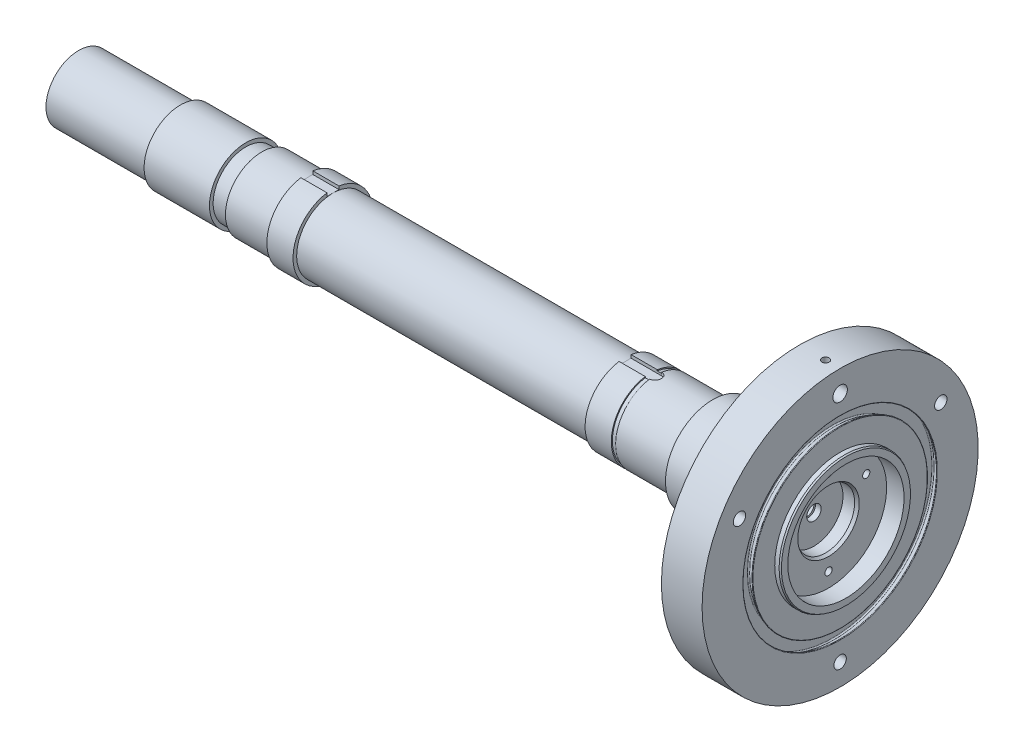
ISO-10303-21;
HEADER;
FILE_DESCRIPTION(('STEP AP214'),'2;1');
FILE_NAME('part.step','',(''),(''),'','','');
FILE_SCHEMA(('AUTOMOTIVE_DESIGN { 1 0 10303 214 1 1 1 1 }'));
ENDSEC;
DATA;
#1=APPLICATION_CONTEXT('core data for automotive mechanical design processes');
#2=APPLICATION_PROTOCOL_DEFINITION('international standard','automotive_design',2000,#1);
#3=PRODUCT_CONTEXT('',#1,'mechanical');
#4=PRODUCT('Part','Part','',(#3));
#5=PRODUCT_RELATED_PRODUCT_CATEGORY('part','',(#4));
#6=PRODUCT_DEFINITION_FORMATION('','',#4);
#7=PRODUCT_DEFINITION_CONTEXT('part definition',#1,'design');
#8=PRODUCT_DEFINITION('design','',#6,#7);
#9=PRODUCT_DEFINITION_SHAPE('','',#8);
#10=(LENGTH_UNIT() NAMED_UNIT(*) SI_UNIT(.MILLI.,.METRE.));
#11=(NAMED_UNIT(*) PLANE_ANGLE_UNIT() SI_UNIT($,.RADIAN.));
#12=(NAMED_UNIT(*) SI_UNIT($,.STERADIAN.) SOLID_ANGLE_UNIT());
#13=UNCERTAINTY_MEASURE_WITH_UNIT(LENGTH_MEASURE(1.E-05),#10,'distance_accuracy_value','');
#14=(GEOMETRIC_REPRESENTATION_CONTEXT(3) GLOBAL_UNCERTAINTY_ASSIGNED_CONTEXT((#13)) GLOBAL_UNIT_ASSIGNED_CONTEXT((#10,
#11,#12)) REPRESENTATION_CONTEXT('',''));
#15=CARTESIAN_POINT('',(0.,0.,0.));
#16=DIRECTION('',(0.,0.,1.));
#17=DIRECTION('',(1.,0.,0.));
#18=AXIS2_PLACEMENT_3D('',#15,#16,#17);
#19=CARTESIAN_POINT('',(0.,0.,0.));
#20=DIRECTION('',(1.,0.,0.));
#21=DIRECTION('',(0.,0.,-1.));
#22=AXIS2_PLACEMENT_3D('',#19,#20,#21);
#23=CONICAL_SURFACE('',#22,38.,0.785398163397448);
#24=CARTESIAN_POINT('',(-2.99999999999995,0.,0.));
#25=DIRECTION('',(1.,0.,0.));
#26=DIRECTION('',(0.,0.,-1.));
#27=AXIS2_PLACEMENT_3D('',#24,#25,#26);
#28=CIRCLE('',#27,35.);
#29=CARTESIAN_POINT('',(-2.99999999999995,0.,-35.));
#30=VERTEX_POINT('',#29);
#31=EDGE_CURVE('E13',#30,#30,#28,.F.);
#32=ORIENTED_EDGE('',*,*,#31,.F.);
#33=EDGE_LOOP('',(#32));
#34=FACE_BOUND('',#33,.T.);
#35=CARTESIAN_POINT('',(0.,0.,0.));
#36=DIRECTION('',(1.,0.,0.));
#37=DIRECTION('',(0.,0.,-1.));
#38=AXIS2_PLACEMENT_3D('',#35,#36,#37);
#39=CIRCLE('',#38,38.);
#40=CARTESIAN_POINT('',(0.,0.,-38.));
#41=VERTEX_POINT('',#40);
#42=EDGE_CURVE('E547',#41,#41,#39,.T.);
#43=ORIENTED_EDGE('',*,*,#42,.F.);
#44=EDGE_LOOP('',(#43));
#45=FACE_BOUND('',#44,.T.);
#46=ADVANCED_FACE('F541',(#34,#45),#23,.T.);
#47=CARTESIAN_POINT('',(-396.257920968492,0.,0.));
#48=DIRECTION('',(-1.,0.,0.));
#49=DIRECTION('',(0.,0.,1.));
#50=AXIS2_PLACEMENT_3D('',#47,#48,#49);
#51=CYLINDRICAL_SURFACE('',#50,35.);
#52=CARTESIAN_POINT('',(0.,0.,0.));
#53=DIRECTION('',(1.,0.,0.));
#54=DIRECTION('',(0.,0.,-1.));
#55=AXIS2_PLACEMENT_3D('',#52,#53,#54);
#56=CIRCLE('',#55,35.);
#57=CARTESIAN_POINT('',(0.,0.,-35.));
#58=VERTEX_POINT('',#57);
#59=EDGE_CURVE('E551',#58,#58,#56,.T.);
#60=ORIENTED_EDGE('',*,*,#59,.T.);
#61=EDGE_LOOP('',(#60));
#62=FACE_BOUND('',#61,.T.);
#63=ORIENTED_EDGE('',*,*,#31,.T.);
#64=EDGE_LOOP('',(#63));
#65=FACE_BOUND('',#64,.T.);
#66=ADVANCED_FACE('F558',(#62,#65),#51,.F.);
#67=CARTESIAN_POINT('',(0.,22.,0.));
#68=DIRECTION('',(1.,0.,0.));
#69=DIRECTION('',(0.,0.,-1.));
#70=AXIS2_PLACEMENT_3D('',#67,#68,#69);
#71=PLANE('',#70);
#72=ORIENTED_EDGE('',*,*,#59,.F.);
#73=EDGE_LOOP('',(#72));
#74=FACE_BOUND('',#73,.T.);
#75=ORIENTED_EDGE('',*,*,#42,.T.);
#76=EDGE_LOOP('',(#75));
#77=FACE_BOUND('',#76,.T.);
#78=ADVANCED_FACE('F560',(#74,#77),#71,.T.);
#79=CLOSED_SHELL('',(#46,#66,#78));
#80=MANIFOLD_SOLID_BREP('B2',#79);
#81=CARTESIAN_POINT('',(-44.1394663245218,0.,0.));
#82=DIRECTION('',(-1.,0.,0.));
#83=DIRECTION('',(0.,0.,1.));
#84=AXIS2_PLACEMENT_3D('',#81,#82,#83);
#85=CYLINDRICAL_SURFACE('',#84,95.);
#86=CARTESIAN_POINT('',(28.,0.,0.));
#87=DIRECTION('',(-1.,0.,0.));
#88=DIRECTION('',(0.,0.,1.));
#89=AXIS2_PLACEMENT_3D('',#86,#87,#88);
#90=CIRCLE('',#89,95.);
#91=CARTESIAN_POINT('',(28.,0.,95.));
#92=VERTEX_POINT('',#91);
#93=EDGE_CURVE('E694',#92,#92,#90,.T.);
#94=ORIENTED_EDGE('',*,*,#93,.T.);
#95=EDGE_LOOP('',(#94));
#96=FACE_BOUND('',#95,.T.);
#97=CARTESIAN_POINT('',(0.,0.,0.));
#98=DIRECTION('',(-1.,0.,0.));
#99=DIRECTION('',(0.,0.,1.));
#100=AXIS2_PLACEMENT_3D('',#97,#98,#99);
#101=CIRCLE('',#100,95.);
#102=CARTESIAN_POINT('',(0.,0.,95.));
#103=VERTEX_POINT('',#102);
#104=EDGE_CURVE('E697',#103,#103,#101,.T.);
#105=ORIENTED_EDGE('',*,*,#104,.F.);
#106=EDGE_LOOP('',(#105));
#107=FACE_BOUND('',#106,.T.);
#108=CARTESIAN_POINT('',(15.4904504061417,95.,0.));
#109=CARTESIAN_POINT('',(15.4904566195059,94.9999995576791,0.140208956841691));
#110=CARTESIAN_POINT('',(15.5023031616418,94.9996862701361,0.280519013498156));
#111=CARTESIAN_POINT('',(15.5493951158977,94.9984666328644,0.557271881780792));
#112=CARTESIAN_POINT('',(15.5846685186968,94.9975595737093,0.693709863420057));
#113=CARTESIAN_POINT('',(15.6776038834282,94.995255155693,0.958667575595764));
#114=CARTESIAN_POINT('',(15.7352546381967,94.9938580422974,1.08719123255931));
#115=CARTESIAN_POINT('',(15.8712859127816,94.9907310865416,1.33270412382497));
#116=CARTESIAN_POINT('',(15.9496613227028,94.9890013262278,1.4496961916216));
#117=CARTESIAN_POINT('',(16.1249753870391,94.9854021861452,1.66895899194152));
#118=CARTESIAN_POINT('',(16.2219267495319,94.9835327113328,1.77121956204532));
#119=CARTESIAN_POINT('',(16.431600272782,94.979865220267,1.9580493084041));
#120=CARTESIAN_POINT('',(16.5443231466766,94.9780672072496,2.04261768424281));
#121=CARTESIAN_POINT('',(16.7825446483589,94.9747413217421,2.19182821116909));
#122=CARTESIAN_POINT('',(16.9080654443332,94.9732139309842,2.25643497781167));
#123=CARTESIAN_POINT('',(17.1681525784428,94.9706042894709,2.36372950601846));
#124=CARTESIAN_POINT('',(17.3027190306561,94.9695220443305,2.40641699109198));
#125=CARTESIAN_POINT('',(17.5774851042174,94.9679210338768,2.46879756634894));
#126=CARTESIAN_POINT('',(17.717699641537,94.9674038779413,2.48842499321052));
#127=CARTESIAN_POINT('',(17.9994369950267,94.9669958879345,2.50394774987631));
#128=CARTESIAN_POINT('',(18.1409598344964,94.9671050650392,2.49984265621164));
#129=CARTESIAN_POINT('',(18.4217598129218,94.9679381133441,2.46799115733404));
#130=CARTESIAN_POINT('',(18.5610287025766,94.9686638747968,2.44017205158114));
#131=CARTESIAN_POINT('',(18.8329330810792,94.9706503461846,2.36158942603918));
#132=CARTESIAN_POINT('',(18.965568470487,94.9719110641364,2.31082556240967));
#133=CARTESIAN_POINT('',(19.2206282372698,94.9748272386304,2.18768620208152));
#134=CARTESIAN_POINT('',(19.3430377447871,94.9764832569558,2.11527991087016));
#135=CARTESIAN_POINT('',(19.5739307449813,94.9800015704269,1.9509065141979));
#136=CARTESIAN_POINT('',(19.6824143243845,94.981863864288,1.85893953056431));
#137=CARTESIAN_POINT('',(19.8821172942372,94.9855794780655,1.65822837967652));
#138=CARTESIAN_POINT('',(19.973371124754,94.9874328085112,1.5495184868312));
#139=CARTESIAN_POINT('',(20.1362199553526,94.9909235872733,1.31825088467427));
#140=CARTESIAN_POINT('',(20.2078155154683,94.9925610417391,1.19569356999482));
#141=CARTESIAN_POINT('',(20.3289121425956,94.9954254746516,0.94088782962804));
#142=CARTESIAN_POINT('',(20.3785261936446,94.9966545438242,0.808693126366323));
#143=CARTESIAN_POINT('',(20.4547272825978,94.9985740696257,0.537822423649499));
#144=CARTESIAN_POINT('',(20.4813151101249,94.9992645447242,0.399146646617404));
#145=CARTESIAN_POINT('',(20.5105898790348,95.0000260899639,0.120043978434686));
#146=CARTESIAN_POINT('',(20.5134036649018,95.0001004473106,-0.0203696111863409));
#147=CARTESIAN_POINT('',(20.4953798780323,94.9996300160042,-0.299667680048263));
#148=CARTESIAN_POINT('',(20.4745426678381,94.9990852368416,-0.438552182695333));
#149=CARTESIAN_POINT('',(20.4098933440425,94.997439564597,-0.710605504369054));
#150=CARTESIAN_POINT('',(20.3661210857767,94.9963396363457,-0.843783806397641));
#151=CARTESIAN_POINT('',(20.2569118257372,94.993707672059,-1.10093307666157));
#152=CARTESIAN_POINT('',(20.1914745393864,94.9921756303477,-1.22490392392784));
#153=CARTESIAN_POINT('',(20.040596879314,94.9888453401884,-1.46055157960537));
#154=CARTESIAN_POINT('',(19.9550944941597,94.9870462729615,-1.5721886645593));
#155=CARTESIAN_POINT('',(19.7666580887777,94.9833865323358,-1.77962573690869));
#156=CARTESIAN_POINT('',(19.6637235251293,94.981525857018,-1.87542523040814));
#157=CARTESIAN_POINT('',(19.4427125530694,94.9779396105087,-2.04904668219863));
#158=CARTESIAN_POINT('',(19.3245531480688,94.9762148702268,-2.12676301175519));
#159=CARTESIAN_POINT('',(19.076906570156,94.9731056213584,-2.26136242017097));
#160=CARTESIAN_POINT('',(18.9474191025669,94.9717211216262,-2.31824495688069));
#161=CARTESIAN_POINT('',(18.6801643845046,94.9694422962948,-2.40980322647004));
#162=CARTESIAN_POINT('',(18.5423627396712,94.9685501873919,-2.44437865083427));
#163=CARTESIAN_POINT('',(18.26290932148,94.9673667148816,-2.48993695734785));
#164=CARTESIAN_POINT('',(18.1212575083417,94.9670753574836,-2.50091959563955));
#165=CARTESIAN_POINT('',(17.837984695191,94.9671269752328,-2.49895882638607));
#166=CARTESIAN_POINT('',(17.6963638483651,94.9674705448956,-2.48599299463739));
#167=CARTESIAN_POINT('',(17.4173222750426,94.9687550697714,-2.43642503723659));
#168=CARTESIAN_POINT('',(17.2799015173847,94.9696960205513,-2.39982308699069));
#169=CARTESIAN_POINT('',(17.0134752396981,94.9720666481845,-2.30408957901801));
#170=CARTESIAN_POINT('',(16.8844526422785,94.973495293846,-2.24500552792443));
#171=CARTESIAN_POINT('',(16.6382107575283,94.9766801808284,-2.1059526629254));
#172=CARTESIAN_POINT('',(16.5209908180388,94.9784364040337,-2.02598500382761));
#173=CARTESIAN_POINT('',(16.3020799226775,94.9820711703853,-1.84771636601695));
#174=CARTESIAN_POINT('',(16.200339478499,94.9839492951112,-1.7494761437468));
#175=CARTESIAN_POINT('',(16.014823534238,94.9876209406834,-1.53723986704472));
#176=CARTESIAN_POINT('',(15.9310522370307,94.9894144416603,-1.42324013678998));
#177=CARTESIAN_POINT('',(15.7840696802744,94.9927094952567,-1.18301858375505));
#178=CARTESIAN_POINT('',(15.7208158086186,94.9942116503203,-1.0568228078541));
#179=CARTESIAN_POINT('',(15.6164960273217,94.9967570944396,-0.795687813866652));
#180=CARTESIAN_POINT('',(15.5754034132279,94.9978009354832,-0.660759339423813));
#181=CARTESIAN_POINT('',(15.5275082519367,94.9990318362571,-0.437475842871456));
#182=CARTESIAN_POINT('',(15.5136290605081,94.999393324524,-0.350576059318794));
#183=CARTESIAN_POINT('',(15.4950981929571,94.9998775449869,-0.175797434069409));
#184=CARTESIAN_POINT('',(15.4904465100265,95.0000002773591,-0.0879185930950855));
#185=CARTESIAN_POINT('',(15.4904504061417,95.,0.));
#186=B_SPLINE_CURVE_WITH_KNOTS('',3,(#108,#109,#110,#111,#112,#113,#114,#115,#116,#117,#118,
#119,#120,#121,#122,#123,#124,#125,#126,#127,#128,#129,#130,#131,#132,#133,#134,#135,#136,#137,
#138,#139,#140,#141,#142,#143,#144,#145,#146,#147,#148,#149,#150,#151,#152,#153,#154,#155,#156,
#157,#158,#159,#160,#161,#162,#163,#164,#165,#166,#167,#168,#169,#170,#171,#172,#173,#174,#175,
#176,#177,#178,#179,#180,#181,#182,#183,#184,#185),.UNSPECIFIED.,.T.,.F.,(4,2,2,2,2,2,2,2,2,2,2,
2,2,2,2,2,2,2,2,2,2,2,2,2,2,2,2,2,2,2,2,2,2,2,2,2,2,2,4),(0.,0.420305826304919,
0.841114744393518,1.26171318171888,1.68220801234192,2.10299154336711,2.52379410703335,
2.94533837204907,3.36688795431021,3.78963500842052,4.21238960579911,4.63644493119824,
5.06050661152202,5.4851745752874,5.90983989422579,6.33364716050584,6.75744235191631,
7.17903324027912,7.6006096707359,8.01993538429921,8.43925467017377,8.85784768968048,
9.27644620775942,9.69635585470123,10.1162785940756,10.5385958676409,10.9609241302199,
11.3851384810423,11.8093572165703,12.2339733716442,12.6585863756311,13.0823070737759,
13.5060043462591,13.9283172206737,14.3507287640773,14.7722573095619,15.1932767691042,
15.456831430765,15.7203858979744),.UNSPECIFIED.);
#187=CARTESIAN_POINT('',(15.4904504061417,95.,0.));
#188=VERTEX_POINT('',#187);
#189=EDGE_CURVE('E711',#188,#188,#186,.T.);
#190=ORIENTED_EDGE('',*,*,#189,.F.);
#191=EDGE_LOOP('',(#190));
#192=FACE_BOUND('',#191,.T.);
#193=ADVANCED_FACE('F590',(#96,#107,#192),#85,.T.);
#194=CARTESIAN_POINT('',(8.00000000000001,80.,0.));
#195=DIRECTION('',(1.,0.,0.));
#196=DIRECTION('',(0.,0.,-1.));
#197=AXIS2_PLACEMENT_3D('',#194,#195,#196);
#198=CYLINDRICAL_SURFACE('',#197,5.);
#199=CARTESIAN_POINT('',(28.,80.,0.));
#200=DIRECTION('',(1.,0.,0.));
#201=DIRECTION('',(0.,0.,-1.));
#202=AXIS2_PLACEMENT_3D('',#199,#200,#201);
#203=CIRCLE('',#202,5.);
#204=CARTESIAN_POINT('',(28.,80.,-5.));
#205=VERTEX_POINT('',#204);
#206=EDGE_CURVE('E628',#205,#205,#203,.T.);
#207=ORIENTED_EDGE('',*,*,#206,.T.);
#208=EDGE_LOOP('',(#207));
#209=FACE_BOUND('',#208,.T.);
#210=CARTESIAN_POINT('',(8.00000000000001,80.,0.));
#211=DIRECTION('',(1.,0.,0.));
#212=DIRECTION('',(0.,0.,-1.));
#213=AXIS2_PLACEMENT_3D('',#210,#211,#212);
#214=CIRCLE('',#213,5.);
#215=CARTESIAN_POINT('',(8.00000000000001,80.,-5.));
#216=VERTEX_POINT('',#215);
#217=EDGE_CURVE('E622',#216,#216,#214,.T.);
#218=ORIENTED_EDGE('',*,*,#217,.F.);
#219=EDGE_LOOP('',(#218));
#220=FACE_BOUND('',#219,.T.);
#221=CARTESIAN_POINT('',(14.6155637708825,85.,0.));
#222=CARTESIAN_POINT('',(14.6155711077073,84.9999927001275,-0.134228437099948));
#223=CARTESIAN_POINT('',(14.6259953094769,84.9945387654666,-0.268614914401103));
#224=CARTESIAN_POINT('',(14.6673186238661,84.9732399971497,-0.533499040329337));
#225=CARTESIAN_POINT('',(14.6982560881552,84.9573757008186,-0.663988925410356));
#226=CARTESIAN_POINT('',(14.7793551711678,84.9168703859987,-0.916917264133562));
#227=CARTESIAN_POINT('',(14.8294556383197,84.8922573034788,-1.03937989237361));
#228=CARTESIAN_POINT('',(14.9473579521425,84.8365296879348,-1.27377891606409));
#229=CARTESIAN_POINT('',(15.0151582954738,84.8054157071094,-1.38571620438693));
#230=CARTESIAN_POINT('',(15.1704378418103,84.7379047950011,-1.60176779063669));
#231=CARTESIAN_POINT('',(15.2586894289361,84.701328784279,-1.70527092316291));
#232=CARTESIAN_POINT('',(15.4511435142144,84.6276620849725,-1.89610789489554));
#233=CARTESIAN_POINT('',(15.5553550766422,84.5905711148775,-1.98343248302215));
#234=CARTESIAN_POINT('',(15.7824490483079,84.5183890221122,-2.14292891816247));
#235=CARTESIAN_POINT('',(15.9059224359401,84.4834425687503,-2.21433126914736));
#236=CARTESIAN_POINT('',(16.1652897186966,84.4220039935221,-2.33462701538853));
#237=CARTESIAN_POINT('',(16.3011706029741,84.3955031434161,-2.38354367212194));
#238=CARTESIAN_POINT('',(16.570087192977,84.3566398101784,-2.45381114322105));
#239=CARTESIAN_POINT('',(16.7024900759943,84.3433207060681,-2.47704450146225));
#240=CARTESIAN_POINT('',(16.9699353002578,84.329136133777,-2.50175980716));
#241=CARTESIAN_POINT('',(17.1049763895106,84.3282648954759,-2.50325183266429));
#242=CARTESIAN_POINT('',(17.3613945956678,84.3383258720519,-2.48575723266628));
#243=CARTESIAN_POINT('',(17.4829417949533,84.3482418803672,-2.46853384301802));
#244=CARTESIAN_POINT('',(17.7214036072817,84.3768371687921,-2.41746611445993));
#245=CARTESIAN_POINT('',(17.8383165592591,84.3955195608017,-2.38361587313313));
#246=CARTESIAN_POINT('',(18.073142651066,84.4410280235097,-2.29777661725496));
#247=CARTESIAN_POINT('',(18.1905584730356,84.4683306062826,-2.24468860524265));
#248=CARTESIAN_POINT('',(18.4155607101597,84.5275848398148,-2.12263383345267));
#249=CARTESIAN_POINT('',(18.5231410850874,84.5595393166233,-2.05365740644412));
#250=CARTESIAN_POINT('',(18.7413492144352,84.629902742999,-1.89023554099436));
#251=CARTESIAN_POINT('',(18.8502304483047,84.6685829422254,-1.79356221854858));
#252=CARTESIAN_POINT('',(19.0505200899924,84.7441729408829,-1.58283034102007));
#253=CARTESIAN_POINT('',(19.1419204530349,84.7810819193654,-1.46876382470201));
#254=CARTESIAN_POINT('',(19.306155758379,84.8500148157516,-1.22232955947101));
#255=CARTESIAN_POINT('',(19.3784987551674,84.8819020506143,-1.08959180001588));
#256=CARTESIAN_POINT('',(19.4979705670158,84.9357497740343,-0.811385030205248));
#257=CARTESIAN_POINT('',(19.5451325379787,84.957723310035,-0.665933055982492));
#258=CARTESIAN_POINT('',(19.6071162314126,84.9868470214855,-0.385660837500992));
#259=CARTESIAN_POINT('',(19.6251846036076,84.9954799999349,-0.251712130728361));
#260=CARTESIAN_POINT('',(19.6383940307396,85.0017779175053,0.0175451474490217));
#261=CARTESIAN_POINT('',(19.6335475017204,84.9994487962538,0.152852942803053));
#262=CARTESIAN_POINT('',(19.6028200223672,84.98485562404,0.407340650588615));
#263=CARTESIAN_POINT('',(19.5789800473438,84.973555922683,0.526832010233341));
#264=CARTESIAN_POINT('',(19.5140056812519,84.9433052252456,0.759972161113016));
#265=CARTESIAN_POINT('',(19.4728688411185,84.9243531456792,0.873620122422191));
#266=CARTESIAN_POINT('',(19.3729566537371,84.8795187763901,1.09719636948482));
#267=CARTESIAN_POINT('',(19.3135232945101,84.85338270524,1.20677745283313));
#268=CARTESIAN_POINT('',(19.1797540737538,84.7967685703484,1.41516464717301));
#269=CARTESIAN_POINT('',(19.1054118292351,84.7662886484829,1.51396611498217));
#270=CARTESIAN_POINT('',(18.933345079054,84.6993115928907,1.71133498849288));
#271=CARTESIAN_POINT('',(18.8338480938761,84.6625426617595,1.80826774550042));
#272=CARTESIAN_POINT('',(18.6204959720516,84.5899454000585,1.98534065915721));
#273=CARTESIAN_POINT('',(18.5066271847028,84.554118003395,2.0654646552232));
#274=CARTESIAN_POINT('',(18.2561025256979,84.4842024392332,2.21341514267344));
#275=CARTESIAN_POINT('',(18.1183282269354,84.450531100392,2.2795839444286));
#276=CARTESIAN_POINT('',(17.9034064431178,84.4078445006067,2.36047245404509));
#277=CARTESIAN_POINT('',(17.8303736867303,84.394917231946,2.38437745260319));
#278=CARTESIAN_POINT('',(17.6820424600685,84.3722248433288,2.42573895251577));
#279=CARTESIAN_POINT('',(17.6067455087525,84.3624576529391,2.44319967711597));
#280=CARTESIAN_POINT('',(17.46076318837,84.3472269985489,2.4701896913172));
#281=CARTESIAN_POINT('',(17.3902059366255,84.3414763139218,2.48025193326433));
#282=CARTESIAN_POINT('',(17.248337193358,84.3333344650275,2.49444986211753));
#283=CARTESIAN_POINT('',(17.1770261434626,84.3309414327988,2.49858884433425));
#284=CARTESIAN_POINT('',(17.0343102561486,84.3296637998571,2.50080281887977));
#285=CARTESIAN_POINT('',(16.9629054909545,84.3307772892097,2.49888111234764));
#286=CARTESIAN_POINT('',(16.8206859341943,84.336494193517,2.48894457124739));
#287=CARTESIAN_POINT('',(16.7498710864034,84.3410972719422,2.48093032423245));
#288=CARTESIAN_POINT('',(16.5576674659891,84.3582843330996,2.45068989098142));
#289=CARTESIAN_POINT('',(16.4374780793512,84.3742501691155,2.42234224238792));
#290=CARTESIAN_POINT('',(16.2041069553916,84.4144271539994,2.34831294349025));
#291=CARTESIAN_POINT('',(16.0909273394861,84.4386407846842,2.30262607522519));
#292=CARTESIAN_POINT('',(15.8708072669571,84.4934180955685,2.19385324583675));
#293=CARTESIAN_POINT('',(15.7641308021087,84.5241408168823,2.13031526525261));
#294=CARTESIAN_POINT('',(15.5623688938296,84.5884150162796,1.98809780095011));
#295=CARTESIAN_POINT('',(15.4672877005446,84.6219675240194,1.90941279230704));
#296=CARTESIAN_POINT('',(15.2802913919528,84.6926420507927,1.72901384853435));
#297=CARTESIAN_POINT('',(15.1898937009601,84.7297477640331,1.62571444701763));
#298=CARTESIAN_POINT('',(15.0269237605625,84.800056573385,1.40460390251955));
#299=CARTESIAN_POINT('',(14.9543625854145,84.8332572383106,1.28678381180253));
#300=CARTESIAN_POINT('',(14.8273371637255,84.8932211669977,1.03606549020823));
#301=CARTESIAN_POINT('',(14.7734039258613,84.9197903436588,0.902850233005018));
#302=CARTESIAN_POINT('',(14.6884169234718,84.9623536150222,0.627911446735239));
#303=CARTESIAN_POINT('',(14.65730661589,84.9783738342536,0.486209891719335));
#304=CARTESIAN_POINT('',(14.6306825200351,84.9921426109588,0.285971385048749));
#305=CARTESIAN_POINT('',(14.6250197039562,84.995081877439,0.22897388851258));
#306=CARTESIAN_POINT('',(14.6174587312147,84.9990121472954,0.114660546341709));
#307=CARTESIAN_POINT('',(14.6155606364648,85.000003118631,0.0573446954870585));
#308=CARTESIAN_POINT('',(14.6155637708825,85.,0.));
#309=B_SPLINE_CURVE_WITH_KNOTS('',3,(#221,#222,#223,#224,#225,#226,#227,#228,#229,#230,#231,
#232,#233,#234,#235,#236,#237,#238,#239,#240,#241,#242,#243,#244,#245,#246,#247,#248,#249,#250,
#251,#252,#253,#254,#255,#256,#257,#258,#259,#260,#261,#262,#263,#264,#265,#266,#267,#268,#269,
#270,#271,#272,#273,#274,#275,#276,#277,#278,#279,#280,#281,#282,#283,#284,#285,#286,#287,#288,
#289,#290,#291,#292,#293,#294,#295,#296,#297,#298,#299,#300,#301,#302,#303,#304,#305,#306,#307,
#308),.UNSPECIFIED.,.T.,.F.,(4,2,2,2,2,2,2,2,2,2,2,2,2,2,2,2,2,2,2,2,2,2,2,2,2,2,2,2,2,2,2,2,2,
2,2,2,2,2,2,2,2,2,2,4),(0.,0.402457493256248,0.80566955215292,1.20760550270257,1.60950732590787,
2.03021551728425,2.45116353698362,2.88939760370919,3.32717729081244,3.73014851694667,
4.1329329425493,4.50081683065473,4.86883140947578,5.26247391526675,5.6563565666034,
6.10631352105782,6.55647705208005,7.01732137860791,7.47755740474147,7.88157616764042,
8.28537604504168,8.65083396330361,9.0163436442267,9.39694138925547,9.77770243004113,
10.2069905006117,10.6366894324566,11.1034660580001,11.336947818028,11.5702762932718,
11.7844727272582,11.998549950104,12.2125105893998,12.4264505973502,12.7980959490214,
13.1698532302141,13.5520363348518,13.9343591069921,14.3590329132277,14.7839697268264,
15.2201767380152,15.655299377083,15.8272333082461,15.9991700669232),.UNSPECIFIED.);
#310=CARTESIAN_POINT('',(14.6155637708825,85.,0.));
#311=VERTEX_POINT('',#310);
#312=EDGE_CURVE('E704',#311,#311,#309,.T.);
#313=ORIENTED_EDGE('',*,*,#312,.F.);
#314=EDGE_LOOP('',(#313));
#315=FACE_BOUND('',#314,.T.);
#316=ADVANCED_FACE('F714',(#209,#220,#315),#198,.F.);
#317=CARTESIAN_POINT('',(-44.1394663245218,0.,0.));
#318=DIRECTION('',(-1.,0.,0.));
#319=DIRECTION('',(0.,0.,1.));
#320=AXIS2_PLACEMENT_3D('',#317,#318,#319);
#321=CYLINDRICAL_SURFACE('',#320,22.);
#322=CARTESIAN_POINT('',(6.00000000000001,0.,0.));
#323=DIRECTION('',(-1.,0.,0.));
#324=DIRECTION('',(0.,0.,1.));
#325=AXIS2_PLACEMENT_3D('',#322,#323,#324);
#326=CIRCLE('',#325,22.);
#327=CARTESIAN_POINT('',(6.00000000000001,0.,22.));
#328=VERTEX_POINT('',#327);
#329=EDGE_CURVE('E649',#328,#328,#326,.T.);
#330=ORIENTED_EDGE('',*,*,#329,.F.);
#331=EDGE_LOOP('',(#330));
#332=FACE_BOUND('',#331,.T.);
#333=CARTESIAN_POINT('',(0.,0.,0.));
#334=DIRECTION('',(-1.,0.,0.));
#335=DIRECTION('',(0.,0.,1.));
#336=AXIS2_PLACEMENT_3D('',#333,#334,#335);
#337=CIRCLE('',#336,22.);
#338=CARTESIAN_POINT('',(0.,0.,22.));
#339=VERTEX_POINT('',#338);
#340=EDGE_CURVE('E700',#339,#339,#337,.T.);
#341=ORIENTED_EDGE('',*,*,#340,.T.);
#342=EDGE_LOOP('',(#341));
#343=FACE_BOUND('',#342,.T.);
#344=ADVANCED_FACE('F592',(#332,#343),#321,.F.);
#345=CARTESIAN_POINT('',(0.,22.,0.));
#346=DIRECTION('',(1.,0.,0.));
#347=DIRECTION('',(0.,0.,-1.));
#348=AXIS2_PLACEMENT_3D('',#345,#346,#347);
#349=PLANE('',#348);
#350=CARTESIAN_POINT('',(0.,40.0000000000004,-69.2820323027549));
#351=DIRECTION('',(1.,0.,0.));
#352=DIRECTION('',(0.,0.,-1.));
#353=AXIS2_PLACEMENT_3D('',#350,#351,#352);
#354=CIRCLE('',#353,4.24999999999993);
#355=CARTESIAN_POINT('',(0.,40.0000000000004,-73.5320323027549));
#356=VERTEX_POINT('',#355);
#357=EDGE_CURVE('E757',#356,#356,#354,.T.);
#358=ORIENTED_EDGE('',*,*,#357,.T.);
#359=EDGE_LOOP('',(#358));
#360=FACE_BOUND('',#359,.T.);
#361=CARTESIAN_POINT('',(0.,40.0000000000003,69.2820323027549));
#362=DIRECTION('',(1.,0.,0.));
#363=DIRECTION('',(0.,0.,-1.));
#364=AXIS2_PLACEMENT_3D('',#361,#362,#363);
#365=CIRCLE('',#364,4.24999999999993);
#366=CARTESIAN_POINT('',(0.,40.0000000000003,65.032032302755));
#367=VERTEX_POINT('',#366);
#368=EDGE_CURVE('E761',#367,#367,#365,.T.);
#369=ORIENTED_EDGE('',*,*,#368,.T.);
#370=EDGE_LOOP('',(#369));
#371=FACE_BOUND('',#370,.T.);
#372=CARTESIAN_POINT('',(0.,-80.,0.));
#373=DIRECTION('',(1.,0.,0.));
#374=DIRECTION('',(0.,0.,-1.));
#375=AXIS2_PLACEMENT_3D('',#372,#373,#374);
#376=CIRCLE('',#375,4.24999999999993);
#377=CARTESIAN_POINT('',(0.,-80.,-4.24999999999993));
#378=VERTEX_POINT('',#377);
#379=EDGE_CURVE('E712',#378,#378,#376,.T.);
#380=ORIENTED_EDGE('',*,*,#379,.T.);
#381=EDGE_LOOP('',(#380));
#382=FACE_BOUND('',#381,.T.);
#383=CARTESIAN_POINT('',(0.,80.,0.));
#384=DIRECTION('',(1.,0.,0.));
#385=DIRECTION('',(0.,0.,-1.));
#386=AXIS2_PLACEMENT_3D('',#383,#384,#385);
#387=CIRCLE('',#386,2.);
#388=CARTESIAN_POINT('',(0.,80.,-2.));
#389=VERTEX_POINT('',#388);
#390=EDGE_CURVE('E768',#389,#389,#387,.T.);
#391=ORIENTED_EDGE('',*,*,#390,.T.);
#392=EDGE_LOOP('',(#391));
#393=FACE_BOUND('',#392,.T.);
#394=ORIENTED_EDGE('',*,*,#340,.F.);
#395=EDGE_LOOP('',(#394));
#396=FACE_BOUND('',#395,.T.);
#397=ORIENTED_EDGE('',*,*,#104,.T.);
#398=EDGE_LOOP('',(#397));
#399=FACE_BOUND('',#398,.T.);
#400=ADVANCED_FACE('F743',(#360,#371,#382,#393,#396,#399),#349,.F.);
#401=CARTESIAN_POINT('',(28.,67.,0.));
#402=DIRECTION('',(-1.,0.,0.));
#403=DIRECTION('',(0.,0.,1.));
#404=AXIS2_PLACEMENT_3D('',#401,#402,#403);
#405=PLANE('',#404);
#406=CARTESIAN_POINT('',(28.,40.0000000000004,-69.2820323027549));
#407=DIRECTION('',(1.,0.,0.));
#408=DIRECTION('',(0.,0.,-1.));
#409=AXIS2_PLACEMENT_3D('',#406,#407,#408);
#410=CIRCLE('',#409,4.24999999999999);
#411=CARTESIAN_POINT('',(28.,40.0000000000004,-73.5320323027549));
#412=VERTEX_POINT('',#411);
#413=EDGE_CURVE('E989',#412,#412,#410,.T.);
#414=ORIENTED_EDGE('',*,*,#413,.F.);
#415=EDGE_LOOP('',(#414));
#416=FACE_BOUND('',#415,.T.);
#417=CARTESIAN_POINT('',(28.,40.0000000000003,69.2820323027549));
#418=DIRECTION('',(1.,0.,0.));
#419=DIRECTION('',(0.,0.,-1.));
#420=AXIS2_PLACEMENT_3D('',#417,#418,#419);
#421=CIRCLE('',#420,4.24999999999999);
#422=CARTESIAN_POINT('',(28.,40.0000000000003,65.0320323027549));
#423=VERTEX_POINT('',#422);
#424=EDGE_CURVE('E990',#423,#423,#421,.T.);
#425=ORIENTED_EDGE('',*,*,#424,.F.);
#426=EDGE_LOOP('',(#425));
#427=FACE_BOUND('',#426,.T.);
#428=CARTESIAN_POINT('',(28.,-80.,0.));
#429=DIRECTION('',(1.,0.,0.));
#430=DIRECTION('',(0.,0.,-1.));
#431=AXIS2_PLACEMENT_3D('',#428,#429,#430);
#432=CIRCLE('',#431,4.24999999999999);
#433=CARTESIAN_POINT('',(28.,-80.,-4.24999999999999));
#434=VERTEX_POINT('',#433);
#435=EDGE_CURVE('E996',#434,#434,#432,.T.);
#436=ORIENTED_EDGE('',*,*,#435,.F.);
#437=EDGE_LOOP('',(#436));
#438=FACE_BOUND('',#437,.T.);
#439=ORIENTED_EDGE('',*,*,#206,.F.);
#440=EDGE_LOOP('',(#439));
#441=FACE_BOUND('',#440,.T.);
#442=ORIENTED_EDGE('',*,*,#93,.F.);
#443=EDGE_LOOP('',(#442));
#444=FACE_BOUND('',#443,.T.);
#445=CARTESIAN_POINT('',(28.,0.,0.));
#446=DIRECTION('',(-1.,0.,0.));
#447=DIRECTION('',(0.,0.,1.));
#448=AXIS2_PLACEMENT_3D('',#445,#446,#447);
#449=CIRCLE('',#448,67.);
#450=CARTESIAN_POINT('',(28.,0.,67.));
#451=VERTEX_POINT('',#450);
#452=EDGE_CURVE('E691',#451,#451,#449,.T.);
#453=ORIENTED_EDGE('',*,*,#452,.T.);
#454=EDGE_LOOP('',(#453));
#455=FACE_BOUND('',#454,.T.);
#456=ADVANCED_FACE('F741',(#416,#427,#438,#441,#444,#455),#405,.F.);
#457=CARTESIAN_POINT('',(27.7,0.,0.));
#458=DIRECTION('',(-1.,0.,0.));
#459=DIRECTION('',(0.,0.,1.));
#460=AXIS2_PLACEMENT_3D('',#457,#458,#459);
#461=TOROIDAL_SURFACE('',#460,67.,0.300000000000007);
#462=ORIENTED_EDGE('',*,*,#452,.F.);
#463=EDGE_LOOP('',(#462));
#464=FACE_BOUND('',#463,.T.);
#465=CARTESIAN_POINT('',(27.55,0.,0.));
#466=DIRECTION('',(-1.,0.,0.));
#467=DIRECTION('',(0.,0.,1.));
#468=AXIS2_PLACEMENT_3D('',#465,#466,#467);
#469=CIRCLE('',#468,66.7401923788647);
#470=CARTESIAN_POINT('',(27.55,0.,66.7401923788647));
#471=VERTEX_POINT('',#470);
#472=EDGE_CURVE('E688',#471,#471,#469,.T.);
#473=ORIENTED_EDGE('',*,*,#472,.T.);
#474=EDGE_LOOP('',(#473));
#475=FACE_BOUND('',#474,.T.);
#476=ADVANCED_FACE('F750',(#464,#475),#461,.T.);
#477=CARTESIAN_POINT('',(23.85,0.,0.));
#478=DIRECTION('',(-1.,0.,0.));
#479=DIRECTION('',(0.,0.,1.));
#480=AXIS2_PLACEMENT_3D('',#477,#478,#479);
#481=CONICAL_SURFACE('',#480,68.8763883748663,0.523598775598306);
#482=ORIENTED_EDGE('',*,*,#472,.F.);
#483=EDGE_LOOP('',(#482));
#484=FACE_BOUND('',#483,.T.);
#485=CARTESIAN_POINT('',(23.85,0.,0.));
#486=DIRECTION('',(-1.,0.,0.));
#487=DIRECTION('',(0.,0.,1.));
#488=AXIS2_PLACEMENT_3D('',#485,#486,#487);
#489=CIRCLE('',#488,68.8763883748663);
#490=CARTESIAN_POINT('',(23.85,0.,68.8763883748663));
#491=VERTEX_POINT('',#490);
#492=EDGE_CURVE('E685',#491,#491,#489,.T.);
#493=ORIENTED_EDGE('',*,*,#492,.T.);
#494=EDGE_LOOP('',(#493));
#495=FACE_BOUND('',#494,.T.);
#496=ADVANCED_FACE('F802',(#484,#495),#481,.F.);
#497=CARTESIAN_POINT('',(23.5,0.,0.));
#498=DIRECTION('',(-1.,0.,0.));
#499=DIRECTION('',(0.,0.,1.));
#500=AXIS2_PLACEMENT_3D('',#497,#498,#499);
#501=TOROIDAL_SURFACE('',#500,68.2701705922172,0.699999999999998);
#502=ORIENTED_EDGE('',*,*,#492,.F.);
#503=EDGE_LOOP('',(#502));
#504=FACE_BOUND('',#503,.T.);
#505=CARTESIAN_POINT('',(22.8,0.,0.));
#506=DIRECTION('',(-1.,0.,0.));
#507=DIRECTION('',(0.,0.,1.));
#508=AXIS2_PLACEMENT_3D('',#505,#506,#507);
#509=CIRCLE('',#508,68.2701705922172);
#510=CARTESIAN_POINT('',(22.8,0.,68.2701705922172));
#511=VERTEX_POINT('',#510);
#512=EDGE_CURVE('E682',#511,#511,#509,.T.);
#513=ORIENTED_EDGE('',*,*,#512,.T.);
#514=EDGE_LOOP('',(#513));
#515=FACE_BOUND('',#514,.T.);
#516=ADVANCED_FACE('F807',(#504,#515),#501,.F.);
#517=CARTESIAN_POINT('',(22.8,68.2701705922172,0.));
#518=DIRECTION('',(-1.,0.,0.));
#519=DIRECTION('',(0.,0.,1.));
#520=AXIS2_PLACEMENT_3D('',#517,#518,#519);
#521=PLANE('',#520);
#522=ORIENTED_EDGE('',*,*,#512,.F.);
#523=EDGE_LOOP('',(#522));
#524=FACE_BOUND('',#523,.T.);
#525=CARTESIAN_POINT('',(22.8,0.,0.));
#526=DIRECTION('',(-1.,0.,0.));
#527=DIRECTION('',(0.,0.,1.));
#528=AXIS2_PLACEMENT_3D('',#525,#526,#527);
#529=CIRCLE('',#528,58.7298294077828);
#530=CARTESIAN_POINT('',(22.8,0.,58.7298294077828));
#531=VERTEX_POINT('',#530);
#532=EDGE_CURVE('E679',#531,#531,#529,.T.);
#533=ORIENTED_EDGE('',*,*,#532,.T.);
#534=EDGE_LOOP('',(#533));
#535=FACE_BOUND('',#534,.T.);
#536=ADVANCED_FACE('F813',(#524,#535),#521,.F.);
#537=CARTESIAN_POINT('',(23.5,0.,0.));
#538=DIRECTION('',(-1.,0.,0.));
#539=DIRECTION('',(0.,0.,1.));
#540=AXIS2_PLACEMENT_3D('',#537,#538,#539);
#541=TOROIDAL_SURFACE('',#540,58.7298294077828,0.700000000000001);
#542=ORIENTED_EDGE('',*,*,#532,.F.);
#543=EDGE_LOOP('',(#542));
#544=FACE_BOUND('',#543,.T.);
#545=CARTESIAN_POINT('',(23.85,0.,0.));
#546=DIRECTION('',(-1.,0.,0.));
#547=DIRECTION('',(0.,0.,1.));
#548=AXIS2_PLACEMENT_3D('',#545,#546,#547);
#549=CIRCLE('',#548,58.1236116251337);
#550=CARTESIAN_POINT('',(23.85,0.,58.1236116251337));
#551=VERTEX_POINT('',#550);
#552=EDGE_CURVE('E676',#551,#551,#549,.T.);
#553=ORIENTED_EDGE('',*,*,#552,.T.);
#554=EDGE_LOOP('',(#553));
#555=FACE_BOUND('',#554,.T.);
#556=ADVANCED_FACE('F819',(#544,#555),#541,.F.);
#557=CARTESIAN_POINT('',(27.55,0.,0.));
#558=DIRECTION('',(1.,0.,0.));
#559=DIRECTION('',(0.,0.,-1.));
#560=AXIS2_PLACEMENT_3D('',#557,#558,#559);
#561=CONICAL_SURFACE('',#560,60.2598076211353,0.523598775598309);
#562=ORIENTED_EDGE('',*,*,#552,.F.);
#563=EDGE_LOOP('',(#562));
#564=FACE_BOUND('',#563,.T.);
#565=CARTESIAN_POINT('',(27.55,0.,0.));
#566=DIRECTION('',(-1.,0.,0.));
#567=DIRECTION('',(0.,0.,1.));
#568=AXIS2_PLACEMENT_3D('',#565,#566,#567);
#569=CIRCLE('',#568,60.2598076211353);
#570=CARTESIAN_POINT('',(27.55,0.,60.2598076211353));
#571=VERTEX_POINT('',#570);
#572=EDGE_CURVE('E673',#571,#571,#569,.T.);
#573=ORIENTED_EDGE('',*,*,#572,.T.);
#574=EDGE_LOOP('',(#573));
#575=FACE_BOUND('',#574,.T.);
#576=ADVANCED_FACE('F825',(#564,#575),#561,.T.);
#577=CARTESIAN_POINT('',(27.7,0.,0.));
#578=DIRECTION('',(-1.,0.,0.));
#579=DIRECTION('',(0.,0.,1.));
#580=AXIS2_PLACEMENT_3D('',#577,#578,#579);
#581=TOROIDAL_SURFACE('',#580,60.,0.299999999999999);
#582=ORIENTED_EDGE('',*,*,#572,.F.);
#583=EDGE_LOOP('',(#582));
#584=FACE_BOUND('',#583,.T.);
#585=CARTESIAN_POINT('',(28.,0.,0.));
#586=DIRECTION('',(-1.,0.,0.));
#587=DIRECTION('',(0.,0.,1.));
#588=AXIS2_PLACEMENT_3D('',#585,#586,#587);
#589=CIRCLE('',#588,60.);
#590=CARTESIAN_POINT('',(28.,0.,60.));
#591=VERTEX_POINT('',#590);
#592=EDGE_CURVE('E670',#591,#591,#589,.T.);
#593=ORIENTED_EDGE('',*,*,#592,.T.);
#594=EDGE_LOOP('',(#593));
#595=FACE_BOUND('',#594,.T.);
#596=ADVANCED_FACE('F831',(#584,#595),#581,.T.);
#597=CARTESIAN_POINT('',(28.,45.,0.));
#598=DIRECTION('',(-1.,0.,0.));
#599=DIRECTION('',(0.,0.,1.));
#600=AXIS2_PLACEMENT_3D('',#597,#598,#599);
#601=PLANE('',#600);
#602=ORIENTED_EDGE('',*,*,#592,.F.);
#603=EDGE_LOOP('',(#602));
#604=FACE_BOUND('',#603,.T.);
#605=CARTESIAN_POINT('',(28.,0.,0.));
#606=DIRECTION('',(-1.,0.,0.));
#607=DIRECTION('',(0.,0.,1.));
#608=AXIS2_PLACEMENT_3D('',#605,#606,#607);
#609=CIRCLE('',#608,45.);
#610=CARTESIAN_POINT('',(28.,0.,45.));
#611=VERTEX_POINT('',#610);
#612=EDGE_CURVE('E667',#611,#611,#609,.T.);
#613=ORIENTED_EDGE('',*,*,#612,.T.);
#614=EDGE_LOOP('',(#613));
#615=FACE_BOUND('',#614,.T.);
#616=ADVANCED_FACE('F837',(#604,#615),#601,.F.);
#617=CARTESIAN_POINT('',(-44.1394663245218,0.,0.));
#618=DIRECTION('',(-1.,0.,0.));
#619=DIRECTION('',(0.,0.,1.));
#620=AXIS2_PLACEMENT_3D('',#617,#618,#619);
#621=CYLINDRICAL_SURFACE('',#620,45.);
#622=CARTESIAN_POINT('',(31.,0.,0.));
#623=DIRECTION('',(-1.,0.,0.));
#624=DIRECTION('',(0.,0.,1.));
#625=AXIS2_PLACEMENT_3D('',#622,#623,#624);
#626=CIRCLE('',#625,45.);
#627=CARTESIAN_POINT('',(31.,0.,45.));
#628=VERTEX_POINT('',#627);
#629=EDGE_CURVE('E598',#628,#628,#626,.T.);
#630=ORIENTED_EDGE('',*,*,#629,.T.);
#631=EDGE_LOOP('',(#630));
#632=FACE_BOUND('',#631,.T.);
#633=ORIENTED_EDGE('',*,*,#612,.F.);
#634=EDGE_LOOP('',(#633));
#635=FACE_BOUND('',#634,.T.);
#636=ADVANCED_FACE('F843',(#632,#635),#621,.T.);
#637=CARTESIAN_POINT('',(32.,45.,0.));
#638=DIRECTION('',(-1.,0.,0.));
#639=DIRECTION('',(0.,0.,1.));
#640=AXIS2_PLACEMENT_3D('',#637,#638,#639);
#641=PLANE('',#640);
#642=CARTESIAN_POINT('',(32.,0.,0.));
#643=DIRECTION('',(-1.,0.,0.));
#644=DIRECTION('',(0.,0.,1.));
#645=AXIS2_PLACEMENT_3D('',#642,#643,#644);
#646=CIRCLE('',#645,44.4226497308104);
#647=CARTESIAN_POINT('',(32.,0.,44.4226497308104));
#648=VERTEX_POINT('',#647);
#649=EDGE_CURVE('E539',#648,#648,#646,.F.);
#650=ORIENTED_EDGE('',*,*,#649,.T.);
#651=EDGE_LOOP('',(#650));
#652=FACE_BOUND('',#651,.T.);
#653=CARTESIAN_POINT('',(32.,0.,0.));
#654=DIRECTION('',(-1.,0.,0.));
#655=DIRECTION('',(0.,0.,1.));
#656=AXIS2_PLACEMENT_3D('',#653,#654,#655);
#657=CIRCLE('',#656,40.);
#658=CARTESIAN_POINT('',(32.,0.,40.));
#659=VERTEX_POINT('',#658);
#660=EDGE_CURVE('E664',#659,#659,#657,.T.);
#661=ORIENTED_EDGE('',*,*,#660,.T.);
#662=EDGE_LOOP('',(#661));
#663=FACE_BOUND('',#662,.T.);
#664=ADVANCED_FACE('F848',(#652,#663),#641,.F.);
#665=CARTESIAN_POINT('',(-44.1394663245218,0.,0.));
#666=DIRECTION('',(-1.,0.,0.));
#667=DIRECTION('',(0.,0.,1.));
#668=AXIS2_PLACEMENT_3D('',#665,#666,#667);
#669=CYLINDRICAL_SURFACE('',#668,40.);
#670=ORIENTED_EDGE('',*,*,#660,.F.);
#671=EDGE_LOOP('',(#670));
#672=FACE_BOUND('',#671,.T.);
#673=CARTESIAN_POINT('',(20.,0.,0.));
#674=DIRECTION('',(-1.,0.,0.));
#675=DIRECTION('',(0.,0.,1.));
#676=AXIS2_PLACEMENT_3D('',#673,#674,#675);
#677=CIRCLE('',#676,40.);
#678=CARTESIAN_POINT('',(20.,0.,40.));
#679=VERTEX_POINT('',#678);
#680=EDGE_CURVE('E661',#679,#679,#677,.T.);
#681=ORIENTED_EDGE('',*,*,#680,.T.);
#682=EDGE_LOOP('',(#681));
#683=FACE_BOUND('',#682,.T.);
#684=ADVANCED_FACE('F855',(#672,#683),#669,.F.);
#685=CARTESIAN_POINT('',(20.,20.,0.));
#686=DIRECTION('',(-1.,0.,0.));
#687=DIRECTION('',(0.,0.,1.));
#688=AXIS2_PLACEMENT_3D('',#685,#686,#687);
#689=PLANE('',#688);
#690=CARTESIAN_POINT('',(20.,0.,0.));
#691=DIRECTION('',(-1.,0.,0.));
#692=DIRECTION('',(0.,0.,1.));
#693=AXIS2_PLACEMENT_3D('',#690,#691,#692);
#694=CIRCLE('',#693,21.1547005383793);
#695=CARTESIAN_POINT('',(20.,0.,21.1547005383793));
#696=VERTEX_POINT('',#695);
#697=EDGE_CURVE('E703',#696,#696,#694,.T.);
#698=ORIENTED_EDGE('',*,*,#697,.T.);
#699=EDGE_LOOP('',(#698));
#700=FACE_BOUND('',#699,.T.);
#701=CARTESIAN_POINT('',(20.,30.,0.));
#702=DIRECTION('',(1.,0.,0.));
#703=DIRECTION('',(0.,0.,-1.));
#704=AXIS2_PLACEMENT_3D('',#701,#702,#703);
#705=CIRCLE('',#704,3.99999999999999);
#706=CARTESIAN_POINT('',(20.,30.,-3.99999999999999));
#707=VERTEX_POINT('',#706);
#708=EDGE_CURVE('E621',#707,#707,#705,.T.);
#709=ORIENTED_EDGE('',*,*,#708,.F.);
#710=EDGE_LOOP('',(#709));
#711=FACE_BOUND('',#710,.T.);
#712=CARTESIAN_POINT('',(20.,15.,25.9807621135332));
#713=DIRECTION('',(1.,0.,0.));
#714=DIRECTION('',(0.,0.,-1.));
#715=AXIS2_PLACEMENT_3D('',#712,#713,#714);
#716=CIRCLE('',#715,2.5);
#717=CARTESIAN_POINT('',(20.,15.,23.4807621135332));
#718=VERTEX_POINT('',#717);
#719=EDGE_CURVE('E634',#718,#718,#716,.T.);
#720=ORIENTED_EDGE('',*,*,#719,.F.);
#721=EDGE_LOOP('',(#720));
#722=FACE_BOUND('',#721,.T.);
#723=CARTESIAN_POINT('',(20.,15.,-25.9807621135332));
#724=DIRECTION('',(1.,0.,0.));
#725=DIRECTION('',(0.,0.,-1.));
#726=AXIS2_PLACEMENT_3D('',#723,#724,#725);
#727=CIRCLE('',#726,2.5);
#728=CARTESIAN_POINT('',(20.,15.,-28.4807621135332));
#729=VERTEX_POINT('',#728);
#730=EDGE_CURVE('E640',#729,#729,#727,.T.);
#731=ORIENTED_EDGE('',*,*,#730,.F.);
#732=EDGE_LOOP('',(#731));
#733=FACE_BOUND('',#732,.T.);
#734=CARTESIAN_POINT('',(20.,-30.,0.));
#735=DIRECTION('',(1.,0.,0.));
#736=DIRECTION('',(0.,0.,-1.));
#737=AXIS2_PLACEMENT_3D('',#734,#735,#736);
#738=CIRCLE('',#737,2.5);
#739=CARTESIAN_POINT('',(20.,-30.,-2.50000000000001));
#740=VERTEX_POINT('',#739);
#741=EDGE_CURVE('E646',#740,#740,#738,.T.);
#742=ORIENTED_EDGE('',*,*,#741,.F.);
#743=EDGE_LOOP('',(#742));
#744=FACE_BOUND('',#743,.T.);
#745=ORIENTED_EDGE('',*,*,#680,.F.);
#746=EDGE_LOOP('',(#745));
#747=FACE_BOUND('',#746,.T.);
#748=ADVANCED_FACE('F862',(#700,#711,#722,#733,#744,#747),#689,.F.);
#749=CARTESIAN_POINT('',(-44.1394663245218,0.,0.));
#750=DIRECTION('',(-1.,0.,0.));
#751=DIRECTION('',(0.,0.,1.));
#752=AXIS2_PLACEMENT_3D('',#749,#750,#751);
#753=CYLINDRICAL_SURFACE('',#752,20.);
#754=CARTESIAN_POINT('',(18.,0.,0.));
#755=DIRECTION('',(-1.,0.,0.));
#756=DIRECTION('',(0.,0.,1.));
#757=AXIS2_PLACEMENT_3D('',#754,#755,#756);
#758=CIRCLE('',#757,20.);
#759=CARTESIAN_POINT('',(18.,0.,20.));
#760=VERTEX_POINT('',#759);
#761=EDGE_CURVE('E1106',#760,#760,#758,.F.);
#762=ORIENTED_EDGE('',*,*,#761,.T.);
#763=EDGE_LOOP('',(#762));
#764=FACE_BOUND('',#763,.T.);
#765=CARTESIAN_POINT('',(10.,0.,0.));
#766=DIRECTION('',(-1.,0.,0.));
#767=DIRECTION('',(0.,0.,1.));
#768=AXIS2_PLACEMENT_3D('',#765,#766,#767);
#769=CIRCLE('',#768,20.);
#770=CARTESIAN_POINT('',(10.,0.,20.));
#771=VERTEX_POINT('',#770);
#772=EDGE_CURVE('E658',#771,#771,#769,.T.);
#773=ORIENTED_EDGE('',*,*,#772,.T.);
#774=EDGE_LOOP('',(#773));
#775=FACE_BOUND('',#774,.T.);
#776=ADVANCED_FACE('F866',(#764,#775),#753,.F.);
#777=CARTESIAN_POINT('',(10.,5.,0.));
#778=DIRECTION('',(-1.,0.,0.));
#779=DIRECTION('',(0.,0.,1.));
#780=AXIS2_PLACEMENT_3D('',#777,#778,#779);
#781=PLANE('',#780);
#782=ORIENTED_EDGE('',*,*,#772,.F.);
#783=EDGE_LOOP('',(#782));
#784=FACE_BOUND('',#783,.T.);
#785=CARTESIAN_POINT('',(10.,0.,0.));
#786=DIRECTION('',(-1.,0.,0.));
#787=DIRECTION('',(0.,0.,1.));
#788=AXIS2_PLACEMENT_3D('',#785,#786,#787);
#789=CIRCLE('',#788,5.);
#790=CARTESIAN_POINT('',(10.,0.,5.));
#791=VERTEX_POINT('',#790);
#792=EDGE_CURVE('E655',#791,#791,#789,.T.);
#793=ORIENTED_EDGE('',*,*,#792,.T.);
#794=EDGE_LOOP('',(#793));
#795=FACE_BOUND('',#794,.T.);
#796=ADVANCED_FACE('F870',(#784,#795),#781,.F.);
#797=CARTESIAN_POINT('',(-44.1394663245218,0.,0.));
#798=DIRECTION('',(-1.,0.,0.));
#799=DIRECTION('',(0.,0.,1.));
#800=AXIS2_PLACEMENT_3D('',#797,#798,#799);
#801=CYLINDRICAL_SURFACE('',#800,5.);
#802=ORIENTED_EDGE('',*,*,#792,.F.);
#803=EDGE_LOOP('',(#802));
#804=FACE_BOUND('',#803,.T.);
#805=CARTESIAN_POINT('',(6.00000000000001,0.,0.));
#806=DIRECTION('',(-1.,0.,0.));
#807=DIRECTION('',(0.,0.,1.));
#808=AXIS2_PLACEMENT_3D('',#805,#806,#807);
#809=CIRCLE('',#808,5.);
#810=CARTESIAN_POINT('',(6.00000000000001,0.,5.));
#811=VERTEX_POINT('',#810);
#812=EDGE_CURVE('E652',#811,#811,#809,.T.);
#813=ORIENTED_EDGE('',*,*,#812,.T.);
#814=EDGE_LOOP('',(#813));
#815=FACE_BOUND('',#814,.T.);
#816=ADVANCED_FACE('F874',(#804,#815),#801,.F.);
#817=CARTESIAN_POINT('',(6.,22.,0.));
#818=DIRECTION('',(1.,0.,0.));
#819=DIRECTION('',(0.,0.,-1.));
#820=AXIS2_PLACEMENT_3D('',#817,#818,#819);
#821=PLANE('',#820);
#822=ORIENTED_EDGE('',*,*,#812,.F.);
#823=EDGE_LOOP('',(#822));
#824=FACE_BOUND('',#823,.T.);
#825=ORIENTED_EDGE('',*,*,#329,.T.);
#826=EDGE_LOOP('',(#825));
#827=FACE_BOUND('',#826,.T.);
#828=ADVANCED_FACE('F878',(#824,#827),#821,.F.);
#829=CARTESIAN_POINT('',(20.,-30.,0.));
#830=DIRECTION('',(1.,0.,0.));
#831=DIRECTION('',(0.,0.,-1.));
#832=AXIS2_PLACEMENT_3D('',#829,#830,#831);
#833=CYLINDRICAL_SURFACE('',#832,2.5);
#834=CARTESIAN_POINT('',(5.00000000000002,-30.,0.));
#835=DIRECTION('',(1.,0.,0.));
#836=DIRECTION('',(0.,0.,-1.));
#837=AXIS2_PLACEMENT_3D('',#834,#835,#836);
#838=CIRCLE('',#837,2.5);
#839=CARTESIAN_POINT('',(5.00000000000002,-30.,-2.50000000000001));
#840=VERTEX_POINT('',#839);
#841=EDGE_CURVE('E643',#840,#840,#838,.T.);
#842=ORIENTED_EDGE('',*,*,#841,.F.);
#843=EDGE_LOOP('',(#842));
#844=FACE_BOUND('',#843,.T.);
#845=ORIENTED_EDGE('',*,*,#741,.T.);
#846=EDGE_LOOP('',(#845));
#847=FACE_BOUND('',#846,.T.);
#848=ADVANCED_FACE('F882',(#844,#847),#833,.F.);
#849=CARTESIAN_POINT('',(5.00000000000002,-30.,0.));
#850=DIRECTION('',(1.,0.,0.));
#851=DIRECTION('',(0.,0.,-1.));
#852=AXIS2_PLACEMENT_3D('',#849,#850,#851);
#853=CONICAL_SURFACE('',#852,2.5,1.02974425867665);
#854=CARTESIAN_POINT('',(3.49784845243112,-30.,0.));
#855=VERTEX_POINT('',#854);
#856=VERTEX_LOOP('',#855);
#857=FACE_BOUND('',#856,.T.);
#858=ORIENTED_EDGE('',*,*,#841,.T.);
#859=EDGE_LOOP('',(#858));
#860=FACE_BOUND('',#859,.T.);
#861=ADVANCED_FACE('F886',(#857,#860),#853,.F.);
#862=CARTESIAN_POINT('',(20.,15.,-25.9807621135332));
#863=DIRECTION('',(1.,0.,0.));
#864=DIRECTION('',(0.,0.,-1.));
#865=AXIS2_PLACEMENT_3D('',#862,#863,#864);
#866=CYLINDRICAL_SURFACE('',#865,2.5);
#867=CARTESIAN_POINT('',(5.00000000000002,15.,-25.9807621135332));
#868=DIRECTION('',(1.,0.,0.));
#869=DIRECTION('',(0.,0.,-1.));
#870=AXIS2_PLACEMENT_3D('',#867,#868,#869);
#871=CIRCLE('',#870,2.5);
#872=CARTESIAN_POINT('',(5.00000000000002,15.,-28.4807621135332));
#873=VERTEX_POINT('',#872);
#874=EDGE_CURVE('E637',#873,#873,#871,.T.);
#875=ORIENTED_EDGE('',*,*,#874,.F.);
#876=EDGE_LOOP('',(#875));
#877=FACE_BOUND('',#876,.T.);
#878=ORIENTED_EDGE('',*,*,#730,.T.);
#879=EDGE_LOOP('',(#878));
#880=FACE_BOUND('',#879,.T.);
#881=ADVANCED_FACE('F890',(#877,#880),#866,.F.);
#882=CARTESIAN_POINT('',(5.00000000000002,15.,-25.9807621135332));
#883=DIRECTION('',(1.,0.,0.));
#884=DIRECTION('',(0.,0.,-1.));
#885=AXIS2_PLACEMENT_3D('',#882,#883,#884);
#886=CONICAL_SURFACE('',#885,2.5,1.02974425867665);
#887=CARTESIAN_POINT('',(3.49784845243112,15.,-25.9807621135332));
#888=VERTEX_POINT('',#887);
#889=VERTEX_LOOP('',#888);
#890=FACE_BOUND('',#889,.T.);
#891=ORIENTED_EDGE('',*,*,#874,.T.);
#892=EDGE_LOOP('',(#891));
#893=FACE_BOUND('',#892,.T.);
#894=ADVANCED_FACE('F893',(#890,#893),#886,.F.);
#895=CARTESIAN_POINT('',(20.,15.,25.9807621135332));
#896=DIRECTION('',(1.,0.,0.));
#897=DIRECTION('',(0.,0.,-1.));
#898=AXIS2_PLACEMENT_3D('',#895,#896,#897);
#899=CYLINDRICAL_SURFACE('',#898,2.5);
#900=CARTESIAN_POINT('',(5.00000000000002,15.,25.9807621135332));
#901=DIRECTION('',(1.,0.,0.));
#902=DIRECTION('',(0.,0.,-1.));
#903=AXIS2_PLACEMENT_3D('',#900,#901,#902);
#904=CIRCLE('',#903,2.5);
#905=CARTESIAN_POINT('',(5.00000000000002,15.,23.4807621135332));
#906=VERTEX_POINT('',#905);
#907=EDGE_CURVE('E625',#906,#906,#904,.T.);
#908=ORIENTED_EDGE('',*,*,#907,.F.);
#909=EDGE_LOOP('',(#908));
#910=FACE_BOUND('',#909,.T.);
#911=ORIENTED_EDGE('',*,*,#719,.T.);
#912=EDGE_LOOP('',(#911));
#913=FACE_BOUND('',#912,.T.);
#914=ADVANCED_FACE('F897',(#910,#913),#899,.F.);
#915=CARTESIAN_POINT('',(5.00000000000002,15.,25.9807621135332));
#916=DIRECTION('',(1.,0.,0.));
#917=DIRECTION('',(0.,0.,-1.));
#918=AXIS2_PLACEMENT_3D('',#915,#916,#917);
#919=CONICAL_SURFACE('',#918,2.5,1.02974425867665);
#920=CARTESIAN_POINT('',(3.49784845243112,15.,25.9807621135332));
#921=VERTEX_POINT('',#920);
#922=VERTEX_LOOP('',#921);
#923=FACE_BOUND('',#922,.T.);
#924=ORIENTED_EDGE('',*,*,#907,.T.);
#925=EDGE_LOOP('',(#924));
#926=FACE_BOUND('',#925,.T.);
#927=ADVANCED_FACE('F900',(#923,#926),#919,.F.);
#928=CARTESIAN_POINT('',(20.,30.,0.));
#929=DIRECTION('',(1.,0.,0.));
#930=DIRECTION('',(0.,0.,-1.));
#931=AXIS2_PLACEMENT_3D('',#928,#929,#930);
#932=CYLINDRICAL_SURFACE('',#931,3.99999999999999);
#933=CARTESIAN_POINT('',(5.00000000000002,30.,0.));
#934=DIRECTION('',(1.,0.,0.));
#935=DIRECTION('',(0.,0.,-1.));
#936=AXIS2_PLACEMENT_3D('',#933,#934,#935);
#937=CIRCLE('',#936,3.99999999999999);
#938=CARTESIAN_POINT('',(5.00000000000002,30.,-3.99999999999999));
#939=VERTEX_POINT('',#938);
#940=EDGE_CURVE('E619',#939,#939,#937,.T.);
#941=ORIENTED_EDGE('',*,*,#940,.F.);
#942=EDGE_LOOP('',(#941));
#943=FACE_BOUND('',#942,.T.);
#944=ORIENTED_EDGE('',*,*,#708,.T.);
#945=EDGE_LOOP('',(#944));
#946=FACE_BOUND('',#945,.T.);
#947=ADVANCED_FACE('F615',(#943,#946),#932,.F.);
#948=CARTESIAN_POINT('',(5.00000000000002,30.,0.));
#949=DIRECTION('',(1.,0.,0.));
#950=DIRECTION('',(0.,0.,-1.));
#951=AXIS2_PLACEMENT_3D('',#948,#949,#950);
#952=CONICAL_SURFACE('',#951,3.99999999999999,0.959931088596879);
#953=CARTESIAN_POINT('',(2.19916984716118,30.,0.));
#954=VERTEX_POINT('',#953);
#955=VERTEX_LOOP('',#954);
#956=FACE_BOUND('',#955,.T.);
#957=ORIENTED_EDGE('',*,*,#940,.T.);
#958=EDGE_LOOP('',(#957));
#959=FACE_BOUND('',#958,.T.);
#960=ADVANCED_FACE('F611',(#956,#959),#952,.F.);
#961=CARTESIAN_POINT('',(8.00000000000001,80.,0.));
#962=DIRECTION('',(1.,0.,0.));
#963=DIRECTION('',(0.,0.,-1.));
#964=AXIS2_PLACEMENT_3D('',#961,#962,#963);
#965=PLANE('',#964);
#966=CARTESIAN_POINT('',(8.00000000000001,80.,0.));
#967=DIRECTION('',(1.,0.,0.));
#968=DIRECTION('',(0.,0.,-1.));
#969=AXIS2_PLACEMENT_3D('',#966,#967,#968);
#970=CIRCLE('',#969,2.);
#971=CARTESIAN_POINT('',(8.00000000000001,80.,-2.));
#972=VERTEX_POINT('',#971);
#973=EDGE_CURVE('E734',#972,#972,#970,.T.);
#974=ORIENTED_EDGE('',*,*,#973,.F.);
#975=EDGE_LOOP('',(#974));
#976=FACE_BOUND('',#975,.T.);
#977=ORIENTED_EDGE('',*,*,#217,.T.);
#978=EDGE_LOOP('',(#977));
#979=FACE_BOUND('',#978,.T.);
#980=ADVANCED_FACE('F614',(#976,#979),#965,.T.);
#981=CARTESIAN_POINT('',(-496.,80.,0.));
#982=DIRECTION('',(1.,0.,0.));
#983=DIRECTION('',(0.,0.,-1.));
#984=AXIS2_PLACEMENT_3D('',#981,#982,#983);
#985=CYLINDRICAL_SURFACE('',#984,2.);
#986=ORIENTED_EDGE('',*,*,#973,.T.);
#987=EDGE_LOOP('',(#986));
#988=FACE_BOUND('',#987,.T.);
#989=ORIENTED_EDGE('',*,*,#390,.F.);
#990=EDGE_LOOP('',(#989));
#991=FACE_BOUND('',#990,.T.);
#992=ADVANCED_FACE('F723',(#988,#991),#985,.F.);
#993=CARTESIAN_POINT('',(18.5714837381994,101.532089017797,0.));
#994=DIRECTION('',(0.0871557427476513,0.996194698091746,0.));
#995=DIRECTION('',(-0.996194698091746,0.0871557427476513,0.));
#996=AXIS2_PLACEMENT_3D('',#993,#994,#995);
#997=CYLINDRICAL_SURFACE('',#996,2.5);
#998=ORIENTED_EDGE('',*,*,#312,.T.);
#999=EDGE_LOOP('',(#998));
#1000=FACE_BOUND('',#999,.T.);
#1001=ORIENTED_EDGE('',*,*,#189,.T.);
#1002=EDGE_LOOP('',(#1001));
#1003=FACE_BOUND('',#1002,.T.);
#1004=ADVANCED_FACE('F717',(#1000,#1003),#997,.F.);
#1005=CARTESIAN_POINT('',(20.,0.,0.));
#1006=DIRECTION('',(1.,0.,0.));
#1007=DIRECTION('',(0.,0.,-1.));
#1008=AXIS2_PLACEMENT_3D('',#1005,#1006,#1007);
#1009=CONICAL_SURFACE('',#1008,21.1547005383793,0.523598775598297);
#1010=ORIENTED_EDGE('',*,*,#761,.F.);
#1011=EDGE_LOOP('',(#1010));
#1012=FACE_BOUND('',#1011,.T.);
#1013=ORIENTED_EDGE('',*,*,#697,.F.);
#1014=EDGE_LOOP('',(#1013));
#1015=FACE_BOUND('',#1014,.T.);
#1016=ADVANCED_FACE('F722',(#1012,#1015),#1009,.F.);
#1017=CARTESIAN_POINT('',(31.,0.,0.));
#1018=DIRECTION('',(-1.,0.,0.));
#1019=DIRECTION('',(0.,0.,1.));
#1020=AXIS2_PLACEMENT_3D('',#1017,#1018,#1019);
#1021=CONICAL_SURFACE('',#1020,45.,0.523598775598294);
#1022=ORIENTED_EDGE('',*,*,#649,.F.);
#1023=EDGE_LOOP('',(#1022));
#1024=FACE_BOUND('',#1023,.T.);
#1025=ORIENTED_EDGE('',*,*,#629,.F.);
#1026=EDGE_LOOP('',(#1025));
#1027=FACE_BOUND('',#1026,.T.);
#1028=ADVANCED_FACE('F955',(#1024,#1027),#1021,.T.);
#1029=CARTESIAN_POINT('',(28.,-80.,0.));
#1030=DIRECTION('',(1.,0.,0.));
#1031=DIRECTION('',(0.,0.,-1.));
#1032=AXIS2_PLACEMENT_3D('',#1029,#1030,#1031);
#1033=CYLINDRICAL_SURFACE('',#1032,4.24999999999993);
#1034=ORIENTED_EDGE('',*,*,#435,.T.);
#1035=EDGE_LOOP('',(#1034));
#1036=FACE_BOUND('',#1035,.T.);
#1037=ORIENTED_EDGE('',*,*,#379,.F.);
#1038=EDGE_LOOP('',(#1037));
#1039=FACE_BOUND('',#1038,.T.);
#1040=ADVANCED_FACE('F961',(#1036,#1039),#1033,.F.);
#1041=CARTESIAN_POINT('',(28.,40.0000000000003,69.2820323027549));
#1042=DIRECTION('',(1.,0.,0.));
#1043=DIRECTION('',(0.,0.,-1.));
#1044=AXIS2_PLACEMENT_3D('',#1041,#1042,#1043);
#1045=CYLINDRICAL_SURFACE('',#1044,4.24999999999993);
#1046=ORIENTED_EDGE('',*,*,#424,.T.);
#1047=EDGE_LOOP('',(#1046));
#1048=FACE_BOUND('',#1047,.T.);
#1049=ORIENTED_EDGE('',*,*,#368,.F.);
#1050=EDGE_LOOP('',(#1049));
#1051=FACE_BOUND('',#1050,.T.);
#1052=ADVANCED_FACE('F968',(#1048,#1051),#1045,.F.);
#1053=CARTESIAN_POINT('',(28.,40.0000000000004,-69.2820323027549));
#1054=DIRECTION('',(1.,0.,0.));
#1055=DIRECTION('',(0.,0.,-1.));
#1056=AXIS2_PLACEMENT_3D('',#1053,#1054,#1055);
#1057=CYLINDRICAL_SURFACE('',#1056,4.24999999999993);
#1058=ORIENTED_EDGE('',*,*,#413,.T.);
#1059=EDGE_LOOP('',(#1058));
#1060=FACE_BOUND('',#1059,.T.);
#1061=ORIENTED_EDGE('',*,*,#357,.F.);
#1062=EDGE_LOOP('',(#1061));
#1063=FACE_BOUND('',#1062,.T.);
#1064=ADVANCED_FACE('F976',(#1060,#1063),#1057,.F.);
#1065=CLOSED_SHELL('',(#193,#316,#344,#400,#456,#476,#496,#516,#536,#556,#576,#596,#616,#636,
#664,#684,#748,#776,#796,#816,#828,#848,#861,#881,#894,#914,#927,#947,#960,#980,#992,#1004,
#1016,#1028,#1040,#1052,#1064));
#1066=MANIFOLD_SOLID_BREP('B8',#1065);
#1067=CARTESIAN_POINT('',(-396.257920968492,0.,0.));
#1068=DIRECTION('',(-1.,0.,0.));
#1069=DIRECTION('',(0.,0.,1.));
#1070=AXIS2_PLACEMENT_3D('',#1067,#1068,#1069);
#1071=CYLINDRICAL_SURFACE('',#1070,22.5);
#1072=CARTESIAN_POINT('',(-496.,0.,0.));
#1073=DIRECTION('',(-1.,0.,0.));
#1074=DIRECTION('',(0.,0.,1.));
#1075=AXIS2_PLACEMENT_3D('',#1072,#1073,#1074);
#1076=CIRCLE('',#1075,22.5);
#1077=CARTESIAN_POINT('',(-496.,0.,22.5));
#1078=VERTEX_POINT('',#1077);
#1079=EDGE_CURVE('E588',#1078,#1078,#1076,.T.);
#1080=ORIENTED_EDGE('',*,*,#1079,.F.);
#1081=EDGE_LOOP('',(#1080));
#1082=FACE_BOUND('',#1081,.T.);
#1083=CARTESIAN_POINT('',(-426.,0.,0.));
#1084=DIRECTION('',(-1.,0.,0.));
#1085=DIRECTION('',(0.,0.,1.));
#1086=AXIS2_PLACEMENT_3D('',#1083,#1084,#1085);
#1087=CIRCLE('',#1086,22.5);
#1088=CARTESIAN_POINT('',(-426.,0.,22.5));
#1089=VERTEX_POINT('',#1088);
#1090=EDGE_CURVE('E1303',#1089,#1089,#1087,.T.);
#1091=ORIENTED_EDGE('',*,*,#1090,.T.);
#1092=EDGE_LOOP('',(#1091));
#1093=FACE_BOUND('',#1092,.T.);
#1094=ADVANCED_FACE('F1130',(#1082,#1093),#1071,.T.);
#1095=CARTESIAN_POINT('',(-496.,5.72,0.));
#1096=DIRECTION('',(1.,0.,0.));
#1097=DIRECTION('',(0.,0.,-1.));
#1098=AXIS2_PLACEMENT_3D('',#1095,#1096,#1097);
#1099=PLANE('',#1098);
#1100=CARTESIAN_POINT('',(-496.,0.,0.));
#1101=DIRECTION('',(-1.,0.,0.));
#1102=DIRECTION('',(0.,0.,1.));
#1103=AXIS2_PLACEMENT_3D('',#1100,#1101,#1102);
#1104=CIRCLE('',#1103,5.72);
#1105=CARTESIAN_POINT('',(-496.,0.,5.72));
#1106=VERTEX_POINT('',#1105);
#1107=EDGE_CURVE('E1137',#1106,#1106,#1104,.T.);
#1108=ORIENTED_EDGE('',*,*,#1107,.F.);
#1109=EDGE_LOOP('',(#1108));
#1110=FACE_BOUND('',#1109,.T.);
#1111=ORIENTED_EDGE('',*,*,#1079,.T.);
#1112=EDGE_LOOP('',(#1111));
#1113=FACE_BOUND('',#1112,.T.);
#1114=ADVANCED_FACE('F1386',(#1110,#1113),#1099,.F.);
#1115=CARTESIAN_POINT('',(-396.257920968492,0.,0.));
#1116=DIRECTION('',(-1.,0.,0.));
#1117=DIRECTION('',(0.,0.,1.));
#1118=AXIS2_PLACEMENT_3D('',#1115,#1116,#1117);
#1119=CYLINDRICAL_SURFACE('',#1118,5.72);
#1120=CARTESIAN_POINT('',(-476.,0.,0.));
#1121=DIRECTION('',(-1.,0.,0.));
#1122=DIRECTION('',(0.,0.,1.));
#1123=AXIS2_PLACEMENT_3D('',#1120,#1121,#1122);
#1124=CIRCLE('',#1123,5.72);
#1125=CARTESIAN_POINT('',(-476.,0.,5.72));
#1126=VERTEX_POINT('',#1125);
#1127=EDGE_CURVE('E1468',#1126,#1126,#1124,.T.);
#1128=ORIENTED_EDGE('',*,*,#1127,.F.);
#1129=EDGE_LOOP('',(#1128));
#1130=FACE_BOUND('',#1129,.T.);
#1131=ORIENTED_EDGE('',*,*,#1107,.T.);
#1132=EDGE_LOOP('',(#1131));
#1133=FACE_BOUND('',#1132,.T.);
#1134=ADVANCED_FACE('F1391',(#1130,#1133),#1119,.F.);
#1135=CARTESIAN_POINT('',(-476.,0.,0.));
#1136=DIRECTION('',(-1.,0.,0.));
#1137=DIRECTION('',(0.,0.,1.));
#1138=AXIS2_PLACEMENT_3D('',#1135,#1136,#1137);
#1139=CONICAL_SURFACE('',#1138,5.72,1.04719755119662);
#1140=CARTESIAN_POINT('',(-475.584307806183,0.,0.));
#1141=DIRECTION('',(-1.,0.,0.));
#1142=DIRECTION('',(0.,0.,1.));
#1143=AXIS2_PLACEMENT_3D('',#1140,#1141,#1142);
#1144=CIRCLE('',#1143,4.99999999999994);
#1145=CARTESIAN_POINT('',(-475.584307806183,0.,4.99999999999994));
#1146=VERTEX_POINT('',#1145);
#1147=EDGE_CURVE('E1465',#1146,#1146,#1144,.T.);
#1148=ORIENTED_EDGE('',*,*,#1147,.F.);
#1149=EDGE_LOOP('',(#1148));
#1150=FACE_BOUND('',#1149,.T.);
#1151=ORIENTED_EDGE('',*,*,#1127,.T.);
#1152=EDGE_LOOP('',(#1151));
#1153=FACE_BOUND('',#1152,.T.);
#1154=ADVANCED_FACE('F1475',(#1150,#1153),#1139,.F.);
#1155=CARTESIAN_POINT('',(-396.257920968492,0.,0.));
#1156=DIRECTION('',(-1.,0.,0.));
#1157=DIRECTION('',(0.,0.,1.));
#1158=AXIS2_PLACEMENT_3D('',#1155,#1156,#1157);
#1159=CYLINDRICAL_SURFACE('',#1158,4.99999999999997);
#1160=CARTESIAN_POINT('',(5.,0.,0.));
#1161=DIRECTION('',(-1.,0.,0.));
#1162=DIRECTION('',(0.,0.,1.));
#1163=AXIS2_PLACEMENT_3D('',#1160,#1161,#1162);
#1164=CIRCLE('',#1163,5.);
#1165=CARTESIAN_POINT('',(5.,0.,5.));
#1166=VERTEX_POINT('',#1165);
#1167=EDGE_CURVE('E1462',#1166,#1166,#1164,.T.);
#1168=ORIENTED_EDGE('',*,*,#1167,.F.);
#1169=EDGE_LOOP('',(#1168));
#1170=FACE_BOUND('',#1169,.T.);
#1171=ORIENTED_EDGE('',*,*,#1147,.T.);
#1172=EDGE_LOOP('',(#1171));
#1173=FACE_BOUND('',#1172,.T.);
#1174=ADVANCED_FACE('F1481',(#1170,#1173),#1159,.F.);
#1175=CARTESIAN_POINT('',(5.,5.,0.));
#1176=DIRECTION('',(-1.,0.,0.));
#1177=DIRECTION('',(0.,0.,1.));
#1178=AXIS2_PLACEMENT_3D('',#1175,#1176,#1177);
#1179=PLANE('',#1178);
#1180=CARTESIAN_POINT('',(5.,0.,0.));
#1181=DIRECTION('',(-1.,0.,0.));
#1182=DIRECTION('',(0.,0.,1.));
#1183=AXIS2_PLACEMENT_3D('',#1180,#1181,#1182);
#1184=CIRCLE('',#1183,22.);
#1185=CARTESIAN_POINT('',(5.,0.,22.));
#1186=VERTEX_POINT('',#1185);
#1187=EDGE_CURVE('E1459',#1186,#1186,#1184,.T.);
#1188=ORIENTED_EDGE('',*,*,#1187,.F.);
#1189=EDGE_LOOP('',(#1188));
#1190=FACE_BOUND('',#1189,.T.);
#1191=ORIENTED_EDGE('',*,*,#1167,.T.);
#1192=EDGE_LOOP('',(#1191));
#1193=FACE_BOUND('',#1192,.T.);
#1194=ADVANCED_FACE('F1488',(#1190,#1193),#1179,.F.);
#1195=CARTESIAN_POINT('',(-396.257920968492,0.,0.));
#1196=DIRECTION('',(-1.,0.,0.));
#1197=DIRECTION('',(0.,0.,1.));
#1198=AXIS2_PLACEMENT_3D('',#1195,#1196,#1197);
#1199=CYLINDRICAL_SURFACE('',#1198,22.);
#1200=CARTESIAN_POINT('',(0.,0.,0.));
#1201=DIRECTION('',(-1.,0.,0.));
#1202=DIRECTION('',(0.,0.,1.));
#1203=AXIS2_PLACEMENT_3D('',#1200,#1201,#1202);
#1204=CIRCLE('',#1203,22.);
#1205=CARTESIAN_POINT('',(0.,0.,22.));
#1206=VERTEX_POINT('',#1205);
#1207=EDGE_CURVE('E1456',#1206,#1206,#1204,.T.);
#1208=ORIENTED_EDGE('',*,*,#1207,.F.);
#1209=EDGE_LOOP('',(#1208));
#1210=FACE_BOUND('',#1209,.T.);
#1211=ORIENTED_EDGE('',*,*,#1187,.T.);
#1212=EDGE_LOOP('',(#1211));
#1213=FACE_BOUND('',#1212,.T.);
#1214=ADVANCED_FACE('F1492',(#1210,#1213),#1199,.T.);
#1215=CARTESIAN_POINT('',(0.,35.,0.));
#1216=DIRECTION('',(-1.,0.,0.));
#1217=DIRECTION('',(0.,0.,1.));
#1218=AXIS2_PLACEMENT_3D('',#1215,#1216,#1217);
#1219=PLANE('',#1218);
#1220=CARTESIAN_POINT('',(0.,0.,0.));
#1221=DIRECTION('',(-1.,0.,0.));
#1222=DIRECTION('',(0.,0.,1.));
#1223=AXIS2_PLACEMENT_3D('',#1220,#1221,#1222);
#1224=CIRCLE('',#1223,35.);
#1225=CARTESIAN_POINT('',(0.,0.,35.));
#1226=VERTEX_POINT('',#1225);
#1227=EDGE_CURVE('E1453',#1226,#1226,#1224,.T.);
#1228=ORIENTED_EDGE('',*,*,#1227,.F.);
#1229=EDGE_LOOP('',(#1228));
#1230=FACE_BOUND('',#1229,.T.);
#1231=ORIENTED_EDGE('',*,*,#1207,.T.);
#1232=EDGE_LOOP('',(#1231));
#1233=FACE_BOUND('',#1232,.T.);
#1234=ADVANCED_FACE('F1496',(#1230,#1233),#1219,.F.);
#1235=CARTESIAN_POINT('',(-396.257920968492,0.,0.));
#1236=DIRECTION('',(-1.,0.,0.));
#1237=DIRECTION('',(0.,0.,1.));
#1238=AXIS2_PLACEMENT_3D('',#1235,#1236,#1237);
#1239=CYLINDRICAL_SURFACE('',#1238,35.);
#1240=CARTESIAN_POINT('',(-25.,0.,0.));
#1241=DIRECTION('',(-1.,0.,0.));
#1242=DIRECTION('',(0.,0.,1.));
#1243=AXIS2_PLACEMENT_3D('',#1240,#1241,#1242);
#1244=CIRCLE('',#1243,35.);
#1245=CARTESIAN_POINT('',(-25.,0.,35.));
#1246=VERTEX_POINT('',#1245);
#1247=EDGE_CURVE('E1450',#1246,#1246,#1244,.T.);
#1248=ORIENTED_EDGE('',*,*,#1247,.F.);
#1249=EDGE_LOOP('',(#1248));
#1250=FACE_BOUND('',#1249,.T.);
#1251=ORIENTED_EDGE('',*,*,#1227,.T.);
#1252=EDGE_LOOP('',(#1251));
#1253=FACE_BOUND('',#1252,.T.);
#1254=ADVANCED_FACE('F1500',(#1250,#1253),#1239,.T.);
#1255=CARTESIAN_POINT('',(-25.,0.,0.));
#1256=DIRECTION('',(1.,0.,0.));
#1257=DIRECTION('',(0.,0.,-1.));
#1258=AXIS2_PLACEMENT_3D('',#1255,#1256,#1257);
#1259=CONICAL_SURFACE('',#1258,35.,0.785398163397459);
#1260=CARTESIAN_POINT('',(-27.5,0.,0.));
#1261=DIRECTION('',(-1.,0.,0.));
#1262=DIRECTION('',(0.,0.,1.));
#1263=AXIS2_PLACEMENT_3D('',#1260,#1261,#1262);
#1264=CIRCLE('',#1263,32.5);
#1265=CARTESIAN_POINT('',(-27.5,0.,32.5));
#1266=VERTEX_POINT('',#1265);
#1267=EDGE_CURVE('E1447',#1266,#1266,#1264,.T.);
#1268=ORIENTED_EDGE('',*,*,#1267,.F.);
#1269=EDGE_LOOP('',(#1268));
#1270=FACE_BOUND('',#1269,.T.);
#1271=ORIENTED_EDGE('',*,*,#1247,.T.);
#1272=EDGE_LOOP('',(#1271));
#1273=FACE_BOUND('',#1272,.T.);
#1274=ADVANCED_FACE('F1504',(#1270,#1273),#1259,.T.);
#1275=CARTESIAN_POINT('',(-396.257920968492,0.,0.));
#1276=DIRECTION('',(-1.,0.,0.));
#1277=DIRECTION('',(0.,0.,1.));
#1278=AXIS2_PLACEMENT_3D('',#1275,#1276,#1277);
#1279=CYLINDRICAL_SURFACE('',#1278,32.5);
#1280=CARTESIAN_POINT('',(-59.7,0.,0.));
#1281=DIRECTION('',(-1.,0.,0.));
#1282=DIRECTION('',(0.,0.,1.));
#1283=AXIS2_PLACEMENT_3D('',#1280,#1281,#1282);
#1284=CIRCLE('',#1283,32.5);
#1285=CARTESIAN_POINT('',(-59.7,0.,32.5));
#1286=VERTEX_POINT('',#1285);
#1287=EDGE_CURVE('E1444',#1286,#1286,#1284,.T.);
#1288=ORIENTED_EDGE('',*,*,#1287,.F.);
#1289=EDGE_LOOP('',(#1288));
#1290=FACE_BOUND('',#1289,.T.);
#1291=ORIENTED_EDGE('',*,*,#1267,.T.);
#1292=EDGE_LOOP('',(#1291));
#1293=FACE_BOUND('',#1292,.T.);
#1294=ADVANCED_FACE('F1508',(#1290,#1293),#1279,.T.);
#1295=CARTESIAN_POINT('',(-59.7,32.5,0.));
#1296=DIRECTION('',(1.,0.,0.));
#1297=DIRECTION('',(0.,0.,-1.));
#1298=AXIS2_PLACEMENT_3D('',#1295,#1296,#1297);
#1299=PLANE('',#1298);
#1300=CARTESIAN_POINT('',(-59.7,0.,0.));
#1301=DIRECTION('',(-1.,0.,0.));
#1302=DIRECTION('',(0.,0.,1.));
#1303=AXIS2_PLACEMENT_3D('',#1300,#1301,#1302);
#1304=CIRCLE('',#1303,27.5);
#1305=CARTESIAN_POINT('',(-59.7,0.,27.5));
#1306=VERTEX_POINT('',#1305);
#1307=EDGE_CURVE('E1441',#1306,#1306,#1304,.T.);
#1308=ORIENTED_EDGE('',*,*,#1307,.F.);
#1309=EDGE_LOOP('',(#1308));
#1310=FACE_BOUND('',#1309,.T.);
#1311=ORIENTED_EDGE('',*,*,#1287,.T.);
#1312=EDGE_LOOP('',(#1311));
#1313=FACE_BOUND('',#1312,.T.);
#1314=ADVANCED_FACE('F1382',(#1310,#1313),#1299,.F.);
#1315=CARTESIAN_POINT('',(-396.257920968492,0.,0.));
#1316=DIRECTION('',(-1.,0.,0.));
#1317=DIRECTION('',(0.,0.,1.));
#1318=AXIS2_PLACEMENT_3D('',#1315,#1316,#1317);
#1319=CYLINDRICAL_SURFACE('',#1318,27.5);
#1320=CARTESIAN_POINT('',(-99.,0.,0.));
#1321=DIRECTION('',(-1.,0.,0.));
#1322=DIRECTION('',(0.,0.,1.));
#1323=AXIS2_PLACEMENT_3D('',#1320,#1321,#1322);
#1324=CIRCLE('',#1323,27.5);
#1325=CARTESIAN_POINT('',(-99.,27.1926460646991,-4.10000000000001));
#1326=VERTEX_POINT('',#1325);
#1327=CARTESIAN_POINT('',(-99.,27.1926460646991,4.1));
#1328=VERTEX_POINT('',#1327);
#1329=EDGE_CURVE('E1438',#1326,#1328,#1324,.T.);
#1330=ORIENTED_EDGE('',*,*,#1329,.F.);
#1331=CARTESIAN_POINT('',(-99.,27.1926460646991,4.1));
#1332=CARTESIAN_POINT('',(-99.2289214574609,27.1926498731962,4.0999905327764));
#1333=CARTESIAN_POINT('',(-99.457976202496,27.195568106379,4.08076259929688));
#1334=CARTESIAN_POINT('',(-99.9096827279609,27.2069179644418,4.00437866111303));
#1335=CARTESIAN_POINT('',(-100.132328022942,27.2153549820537,3.94718555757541));
#1336=CARTESIAN_POINT('',(-100.564611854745,27.2367660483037,3.79661940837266));
#1337=CARTESIAN_POINT('',(-100.774260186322,27.2497366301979,3.70327400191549));
#1338=CARTESIAN_POINT('',(-101.174888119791,27.2787492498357,3.48311783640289));
#1339=CARTESIAN_POINT('',(-101.365870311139,27.2947908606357,3.35631172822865));
#1340=CARTESIAN_POINT('',(-101.725285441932,27.3282799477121,3.0717622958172));
#1341=CARTESIAN_POINT('',(-101.893549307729,27.3457365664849,2.91380646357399));
#1342=CARTESIAN_POINT('',(-102.201286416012,27.3800071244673,2.57190019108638));
#1343=CARTESIAN_POINT('',(-102.340758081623,27.3968210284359,2.38794832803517));
#1344=CARTESIAN_POINT('',(-102.587574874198,27.4280072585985,1.99818933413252));
#1345=CARTESIAN_POINT('',(-102.694764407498,27.4423676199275,1.79228263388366));
#1346=CARTESIAN_POINT('',(-102.872975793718,27.4669275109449,1.36513850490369));
#1347=CARTESIAN_POINT('',(-102.943999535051,27.4771272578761,1.14390187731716));
#1348=CARTESIAN_POINT('',(-103.047350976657,27.4921521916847,0.694118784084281));
#1349=CARTESIAN_POINT('',(-103.079961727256,27.4970166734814,0.465638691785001));
#1350=CARTESIAN_POINT('',(-103.106440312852,27.5009576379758,0.00640117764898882));
#1351=CARTESIAN_POINT('',(-103.100310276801,27.5000344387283,-0.224356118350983));
#1352=CARTESIAN_POINT('',(-103.049704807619,27.4925354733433,-0.679666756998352));
#1353=CARTESIAN_POINT('',(-103.005533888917,27.4860045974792,-0.904254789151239));
#1354=CARTESIAN_POINT('',(-102.880578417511,27.4680741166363,-1.34279498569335));
#1355=CARTESIAN_POINT('',(-102.799792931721,27.4566743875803,-1.55674687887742));
#1356=CARTESIAN_POINT('',(-102.603589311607,27.4302099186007,-1.96886400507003));
#1357=CARTESIAN_POINT('',(-102.488042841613,27.4151316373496,-2.16696723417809));
#1358=CARTESIAN_POINT('',(-102.225690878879,27.3829907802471,-2.54108751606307));
#1359=CARTESIAN_POINT('',(-102.078883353,27.3659280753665,-2.7171031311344));
#1360=CARTESIAN_POINT('',(-101.756479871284,27.3315258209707,-3.04384652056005));
#1361=CARTESIAN_POINT('',(-101.580618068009,27.3141851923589,-3.19431198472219));
#1362=CARTESIAN_POINT('',(-101.206001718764,27.2813432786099,-3.4636359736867));
#1363=CARTESIAN_POINT('',(-101.007247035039,27.265842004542,-3.58249430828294));
#1364=CARTESIAN_POINT('',(-100.592214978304,27.2384342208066,-3.78526472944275));
#1365=CARTESIAN_POINT('',(-100.375924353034,27.2265304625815,-3.86915008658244));
#1366=CARTESIAN_POINT('',(-99.9321073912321,27.207714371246,-3.99933067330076));
#1367=CARTESIAN_POINT('',(-99.7045818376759,27.2008016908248,-4.04562851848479));
#1368=CARTESIAN_POINT('',(-99.2470867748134,27.1928162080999,-4.0989605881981));
#1369=CARTESIAN_POINT('',(-99.0171615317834,27.1916881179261,-4.10636654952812));
#1370=CARTESIAN_POINT('',(-98.5593531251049,27.1952527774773,-4.08269079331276));
#1371=CARTESIAN_POINT('',(-98.3314698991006,27.199945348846,-4.05161025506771));
#1372=CARTESIAN_POINT('',(-97.8853644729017,27.2145718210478,-3.95215895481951));
#1373=CARTESIAN_POINT('',(-97.6671001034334,27.2244797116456,-3.88397319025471));
#1374=CARTESIAN_POINT('',(-97.2450986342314,27.2483990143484,-3.71243934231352));
#1375=CARTESIAN_POINT('',(-97.0413622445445,27.2624106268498,-3.60908954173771));
#1376=CARTESIAN_POINT('',(-96.6525330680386,27.293088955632,-3.36926737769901));
#1377=CARTESIAN_POINT('',(-96.4675903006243,27.3097746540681,-3.23255425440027));
#1378=CARTESIAN_POINT('',(-96.123139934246,27.3438638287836,-2.93022114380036));
#1379=CARTESIAN_POINT('',(-95.9636337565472,27.3612673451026,-2.76459954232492));
#1380=CARTESIAN_POINT('',(-95.673250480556,27.3950038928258,-2.40751426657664));
#1381=CARTESIAN_POINT('',(-95.5426196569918,27.4113269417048,-2.21584923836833));
#1382=CARTESIAN_POINT('',(-95.3154105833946,27.4409084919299,-1.81307964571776));
#1383=CARTESIAN_POINT('',(-95.2188314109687,27.454167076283,-1.60197560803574));
#1384=CARTESIAN_POINT('',(-95.0628611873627,27.4760820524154,-1.16709130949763));
#1385=CARTESIAN_POINT('',(-95.0033351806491,27.4847551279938,-0.943360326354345));
#1386=CARTESIAN_POINT('',(-94.9227241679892,27.4965918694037,-0.488939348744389));
#1387=CARTESIAN_POINT('',(-94.9016366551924,27.4997558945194,-0.258249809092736));
#1388=CARTESIAN_POINT('',(-94.8985618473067,27.5002145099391,0.201150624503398));
#1389=CARTESIAN_POINT('',(-94.9161976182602,27.4975656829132,0.429859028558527));
#1390=CARTESIAN_POINT('',(-94.9892612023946,27.4868102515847,0.881019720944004));
#1391=CARTESIAN_POINT('',(-95.0446888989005,27.4787036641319,1.10347202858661));
#1392=CARTESIAN_POINT('',(-95.1916298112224,27.4579393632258,1.5357045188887));
#1393=CARTESIAN_POINT('',(-95.2831172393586,27.4452849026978,1.74549363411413));
#1394=CARTESIAN_POINT('',(-95.499540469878,27.4168152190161,2.14680263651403));
#1395=CARTESIAN_POINT('',(-95.6244773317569,27.4009998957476,2.33832194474));
#1396=CARTESIAN_POINT('',(-95.9056171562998,27.3677838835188,2.69956720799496));
#1397=CARTESIAN_POINT('',(-96.0620985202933,27.3503698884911,2.86907529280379));
#1398=CARTESIAN_POINT('',(-96.4012997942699,27.3160179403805,3.1795643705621));
#1399=CARTESIAN_POINT('',(-96.5840258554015,27.2990801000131,3.32053865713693));
#1400=CARTESIAN_POINT('',(-96.9717204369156,27.2674974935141,3.57065940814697));
#1401=CARTESIAN_POINT('',(-97.1768067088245,27.2528659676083,3.67962499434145));
#1402=CARTESIAN_POINT('',(-97.6024907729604,27.2277078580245,3.86140116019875));
#1403=CARTESIAN_POINT('',(-97.8230721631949,27.2171770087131,3.93424933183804));
#1404=CARTESIAN_POINT('',(-98.2038752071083,27.2038504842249,4.02515416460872));
#1405=CARTESIAN_POINT('',(-98.3617428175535,27.1996710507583,4.05317851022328));
#1406=CARTESIAN_POINT('',(-98.679718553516,27.1940675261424,4.09060462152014));
#1407=CARTESIAN_POINT('',(-98.8398266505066,27.1926433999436,4.10000662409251));
#1408=CARTESIAN_POINT('',(-99.,27.1926460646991,4.1));
#1409=B_SPLINE_CURVE_WITH_KNOTS('',3,(#1331,#1332,#1333,#1334,#1335,#1336,#1337,#1338,#1339,
#1340,#1341,#1342,#1343,#1344,#1345,#1346,#1347,#1348,#1349,#1350,#1351,#1352,#1353,#1354,#1355,
#1356,#1357,#1358,#1359,#1360,#1361,#1362,#1363,#1364,#1365,#1366,#1367,#1368,#1369,#1370,#1371,
#1372,#1373,#1374,#1375,#1376,#1377,#1378,#1379,#1380,#1381,#1382,#1383,#1384,#1385,#1386,#1387,
#1388,#1389,#1390,#1391,#1392,#1393,#1394,#1395,#1396,#1397,#1398,#1399,#1400,#1401,#1402,#1403,
#1404,#1405,#1406,#1407,#1408),.UNSPECIFIED.,.T.,.F.,(4,2,2,2,2,2,2,2,2,2,2,2,2,2,2,2,2,2,2,2,2,
2,2,2,2,2,2,2,2,2,2,2,2,2,2,2,2,2,4),(0.,0.686178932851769,1.37302937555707,2.05935573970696,
2.74558675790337,3.43667226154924,4.12779560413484,4.82219859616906,5.51656532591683,
6.20578287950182,6.89496255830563,7.57867614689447,8.26240716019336,8.94869411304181,
9.63502571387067,10.3280256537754,11.0210297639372,11.7145625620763,12.4080470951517,
13.0948909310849,13.7817137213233,14.4651431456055,15.1486059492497,15.8371547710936,
16.5257420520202,17.2199931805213,17.9142255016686,18.6059142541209,19.2975578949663,
19.9824989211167,20.6674378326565,21.3518878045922,22.0363594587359,22.7271596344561,
23.4181219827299,24.1129169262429,24.8069871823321,25.2871037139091,25.7672141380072),.UNSPECIFIED.);
#1410=EDGE_CURVE('E1297',#1326,#1328,#1409,.T.);
#1411=ORIENTED_EDGE('',*,*,#1410,.T.);
#1412=EDGE_LOOP('',(#1330,#1411));
#1413=FACE_BOUND('',#1412,.T.);
#1414=ORIENTED_EDGE('',*,*,#1307,.T.);
#1415=EDGE_LOOP('',(#1414));
#1416=FACE_BOUND('',#1415,.T.);
#1417=ADVANCED_FACE('F1305',(#1413,#1416),#1319,.T.);
#1418=CARTESIAN_POINT('',(-99.,26.75,0.));
#1419=DIRECTION('',(1.,0.,0.));
#1420=DIRECTION('',(0.,0.,-1.));
#1421=AXIS2_PLACEMENT_3D('',#1418,#1419,#1420);
#1422=PLANE('',#1421);
#1423=CARTESIAN_POINT('',(-99.,0.,0.));
#1424=DIRECTION('',(-1.,0.,0.));
#1425=DIRECTION('',(0.,0.,1.));
#1426=AXIS2_PLACEMENT_3D('',#1423,#1424,#1425);
#1427=CIRCLE('',#1426,26.75);
#1428=CARTESIAN_POINT('',(-99.,26.4339270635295,-4.10000000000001));
#1429=VERTEX_POINT('',#1428);
#1430=CARTESIAN_POINT('',(-99.,26.4339270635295,4.1));
#1431=VERTEX_POINT('',#1430);
#1432=EDGE_CURVE('E1435',#1429,#1431,#1427,.T.);
#1433=ORIENTED_EDGE('',*,*,#1432,.F.);
#1434=DIRECTION('',(0.,1.,0.));
#1435=VECTOR('',#1434,1.);
#1436=CARTESIAN_POINT('',(-99.,25.,-4.10000000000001));
#1437=LINE('',#1436,#1435);
#1438=EDGE_CURVE('E1641',#1429,#1326,#1437,.T.);
#1439=ORIENTED_EDGE('',*,*,#1438,.T.);
#1440=ORIENTED_EDGE('',*,*,#1329,.T.);
#1441=DIRECTION('',(0.,1.,0.));
#1442=VECTOR('',#1441,1.);
#1443=CARTESIAN_POINT('',(-99.,25.,4.1));
#1444=LINE('',#1443,#1442);
#1445=EDGE_CURVE('E1248',#1431,#1328,#1444,.T.);
#1446=ORIENTED_EDGE('',*,*,#1445,.F.);
#1447=EDGE_LOOP('',(#1433,#1439,#1440,#1446));
#1448=FACE_BOUND('',#1447,.T.);
#1449=ADVANCED_FACE('F1375',(#1448),#1422,.F.);
#1450=CARTESIAN_POINT('',(-396.257920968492,0.,0.));
#1451=DIRECTION('',(-1.,0.,0.));
#1452=DIRECTION('',(0.,0.,1.));
#1453=AXIS2_PLACEMENT_3D('',#1450,#1451,#1452);
#1454=CYLINDRICAL_SURFACE('',#1453,26.75);
#1455=CARTESIAN_POINT('',(-102.,0.,0.));
#1456=DIRECTION('',(-1.,0.,0.));
#1457=DIRECTION('',(0.,0.,1.));
#1458=AXIS2_PLACEMENT_3D('',#1455,#1456,#1457);
#1459=CIRCLE('',#1458,26.75);
#1460=CARTESIAN_POINT('',(-102.,26.4339270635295,-4.10000000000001));
#1461=VERTEX_POINT('',#1460);
#1462=CARTESIAN_POINT('',(-102.,26.4339270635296,4.09999999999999));
#1463=VERTEX_POINT('',#1462);
#1464=EDGE_CURVE('E1432',#1461,#1463,#1459,.T.);
#1465=ORIENTED_EDGE('',*,*,#1464,.F.);
#1466=DIRECTION('',(-1.,0.,0.));
#1467=VECTOR('',#1466,1.);
#1468=CARTESIAN_POINT('',(-396.257920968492,26.4339270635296,-4.09999999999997));
#1469=LINE('',#1468,#1467);
#1470=EDGE_CURVE('E1294',#1461,#1429,#1469,.F.);
#1471=ORIENTED_EDGE('',*,*,#1470,.T.);
#1472=ORIENTED_EDGE('',*,*,#1432,.T.);
#1473=DIRECTION('',(-1.,0.,0.));
#1474=VECTOR('',#1473,1.);
#1475=CARTESIAN_POINT('',(-396.257920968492,26.4339270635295,4.10000000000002));
#1476=LINE('',#1475,#1474);
#1477=EDGE_CURVE('E1276',#1431,#1463,#1476,.T.);
#1478=ORIENTED_EDGE('',*,*,#1477,.T.);
#1479=EDGE_LOOP('',(#1465,#1471,#1472,#1478));
#1480=FACE_BOUND('',#1479,.T.);
#1481=ADVANCED_FACE('F1372',(#1480),#1454,.T.);
#1482=CARTESIAN_POINT('',(-102.,27.5,0.));
#1483=DIRECTION('',(-1.,0.,0.));
#1484=DIRECTION('',(0.,0.,1.));
#1485=AXIS2_PLACEMENT_3D('',#1482,#1483,#1484);
#1486=PLANE('',#1485);
#1487=CARTESIAN_POINT('',(-102.,0.,0.));
#1488=DIRECTION('',(-1.,0.,0.));
#1489=DIRECTION('',(0.,0.,1.));
#1490=AXIS2_PLACEMENT_3D('',#1487,#1488,#1489);
#1491=CIRCLE('',#1490,27.5);
#1492=CARTESIAN_POINT('',(-102.,27.1926460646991,-4.09999999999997));
#1493=VERTEX_POINT('',#1492);
#1494=CARTESIAN_POINT('',(-102.,27.1926460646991,4.10000000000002));
#1495=VERTEX_POINT('',#1494);
#1496=EDGE_CURVE('E1429',#1493,#1495,#1491,.T.);
#1497=ORIENTED_EDGE('',*,*,#1496,.F.);
#1498=DIRECTION('',(0.,-1.,0.));
#1499=VECTOR('',#1498,1.);
#1500=CARTESIAN_POINT('',(-102.,27.5,-4.10000000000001));
#1501=LINE('',#1500,#1499);
#1502=EDGE_CURVE('E1291',#1493,#1461,#1501,.T.);
#1503=ORIENTED_EDGE('',*,*,#1502,.T.);
#1504=ORIENTED_EDGE('',*,*,#1464,.T.);
#1505=DIRECTION('',(0.,1.,0.));
#1506=VECTOR('',#1505,1.);
#1507=CARTESIAN_POINT('',(-102.,27.5,4.09999999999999));
#1508=LINE('',#1507,#1506);
#1509=EDGE_CURVE('E1273',#1463,#1495,#1508,.T.);
#1510=ORIENTED_EDGE('',*,*,#1509,.T.);
#1511=EDGE_LOOP('',(#1497,#1503,#1504,#1510));
#1512=FACE_BOUND('',#1511,.T.);
#1513=ADVANCED_FACE('F1368',(#1512),#1486,.F.);
#1514=CARTESIAN_POINT('',(-396.257920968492,0.,0.));
#1515=DIRECTION('',(-1.,0.,0.));
#1516=DIRECTION('',(0.,0.,1.));
#1517=AXIS2_PLACEMENT_3D('',#1514,#1515,#1516);
#1518=CYLINDRICAL_SURFACE('',#1517,27.5);
#1519=CARTESIAN_POINT('',(-120.,0.,0.));
#1520=DIRECTION('',(-1.,0.,0.));
#1521=DIRECTION('',(0.,0.,1.));
#1522=AXIS2_PLACEMENT_3D('',#1519,#1520,#1521);
#1523=CIRCLE('',#1522,27.4999999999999);
#1524=CARTESIAN_POINT('',(-120.,27.1926460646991,-4.10000000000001));
#1525=VERTEX_POINT('',#1524);
#1526=CARTESIAN_POINT('',(-120.,27.1926460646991,4.09999999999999));
#1527=VERTEX_POINT('',#1526);
#1528=EDGE_CURVE('E1426',#1525,#1527,#1523,.T.);
#1529=ORIENTED_EDGE('',*,*,#1528,.F.);
#1530=DIRECTION('',(-1.,0.,0.));
#1531=VECTOR('',#1530,1.);
#1532=CARTESIAN_POINT('',(-396.257920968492,27.1926460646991,-4.09999999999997));
#1533=LINE('',#1532,#1531);
#1534=EDGE_CURVE('E1288',#1525,#1493,#1533,.F.);
#1535=ORIENTED_EDGE('',*,*,#1534,.T.);
#1536=ORIENTED_EDGE('',*,*,#1496,.T.);
#1537=DIRECTION('',(-1.,0.,0.));
#1538=VECTOR('',#1537,1.);
#1539=CARTESIAN_POINT('',(-396.257920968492,27.1926460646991,4.10000000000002));
#1540=LINE('',#1539,#1538);
#1541=EDGE_CURVE('E1270',#1495,#1527,#1540,.T.);
#1542=ORIENTED_EDGE('',*,*,#1541,.T.);
#1543=EDGE_LOOP('',(#1529,#1535,#1536,#1542));
#1544=FACE_BOUND('',#1543,.T.);
#1545=ADVANCED_FACE('F1364',(#1544),#1518,.T.);
#1546=CARTESIAN_POINT('',(-120.,27.4999999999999,0.));
#1547=DIRECTION('',(1.,0.,0.));
#1548=DIRECTION('',(0.,0.,-1.));
#1549=AXIS2_PLACEMENT_3D('',#1546,#1547,#1548);
#1550=PLANE('',#1549);
#1551=DIRECTION('',(0.,0.,-1.));
#1552=VECTOR('',#1551,1.);
#1553=CARTESIAN_POINT('',(-120.,25.,0.));
#1554=LINE('',#1553,#1552);
#1555=CARTESIAN_POINT('',(-120.,25.,0.));
#1556=VERTEX_POINT('',#1555);
#1557=CARTESIAN_POINT('',(-120.,25.,-4.10000000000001));
#1558=VERTEX_POINT('',#1557);
#1559=EDGE_CURVE('E1260',#1556,#1558,#1554,.T.);
#1560=ORIENTED_EDGE('',*,*,#1559,.T.);
#1561=DIRECTION('',(0.,1.,0.));
#1562=VECTOR('',#1561,1.);
#1563=CARTESIAN_POINT('',(-120.,27.4999999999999,-4.10000000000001));
#1564=LINE('',#1563,#1562);
#1565=EDGE_CURVE('E1285',#1558,#1525,#1564,.T.);
#1566=ORIENTED_EDGE('',*,*,#1565,.T.);
#1567=ORIENTED_EDGE('',*,*,#1528,.T.);
#1568=DIRECTION('',(0.,-1.,0.));
#1569=VECTOR('',#1568,1.);
#1570=CARTESIAN_POINT('',(-120.,27.4999999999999,4.09999999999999));
#1571=LINE('',#1570,#1569);
#1572=CARTESIAN_POINT('',(-120.,25.,4.09999999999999));
#1573=VERTEX_POINT('',#1572);
#1574=EDGE_CURVE('E1267',#1527,#1573,#1571,.T.);
#1575=ORIENTED_EDGE('',*,*,#1574,.T.);
#1576=EDGE_CURVE('E1263',#1573,#1556,#1554,.T.);
#1577=ORIENTED_EDGE('',*,*,#1576,.T.);
#1578=CARTESIAN_POINT('',(-120.,0.,0.));
#1579=DIRECTION('',(-1.,0.,0.));
#1580=DIRECTION('',(0.,0.,1.));
#1581=AXIS2_PLACEMENT_3D('',#1578,#1579,#1580);
#1582=CIRCLE('',#1581,25.);
#1583=EDGE_CURVE('E1423',#1556,#1556,#1582,.T.);
#1584=ORIENTED_EDGE('',*,*,#1583,.F.);
#1585=EDGE_LOOP('',(#1560,#1566,#1567,#1575,#1577,#1584));
#1586=FACE_BOUND('',#1585,.T.);
#1587=ADVANCED_FACE('F1360',(#1586),#1550,.F.);
#1588=CARTESIAN_POINT('',(-396.257920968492,0.,0.));
#1589=DIRECTION('',(-1.,0.,0.));
#1590=DIRECTION('',(0.,0.,1.));
#1591=AXIS2_PLACEMENT_3D('',#1588,#1589,#1590);
#1592=CYLINDRICAL_SURFACE('',#1591,25.);
#1593=CARTESIAN_POINT('',(-321.,0.,0.));
#1594=DIRECTION('',(-1.,0.,0.));
#1595=DIRECTION('',(0.,0.,1.));
#1596=AXIS2_PLACEMENT_3D('',#1593,#1594,#1595);
#1597=CIRCLE('',#1596,25.);
#1598=CARTESIAN_POINT('',(-321.,25.,0.));
#1599=VERTEX_POINT('',#1598);
#1600=EDGE_CURVE('E1420',#1599,#1599,#1597,.T.);
#1601=ORIENTED_EDGE('',*,*,#1600,.F.);
#1602=EDGE_LOOP('',(#1601));
#1603=FACE_BOUND('',#1602,.T.);
#1604=ORIENTED_EDGE('',*,*,#1583,.T.);
#1605=EDGE_LOOP('',(#1604));
#1606=FACE_BOUND('',#1605,.T.);
#1607=ADVANCED_FACE('F1356',(#1603,#1606),#1592,.T.);
#1608=CARTESIAN_POINT('',(-321.,25.,0.));
#1609=DIRECTION('',(-1.,0.,0.));
#1610=DIRECTION('',(0.,0.,1.));
#1611=AXIS2_PLACEMENT_3D('',#1608,#1609,#1610);
#1612=PLANE('',#1611);
#1613=CARTESIAN_POINT('',(-321.,0.,0.));
#1614=DIRECTION('',(-1.,0.,0.));
#1615=DIRECTION('',(0.,0.,1.));
#1616=AXIS2_PLACEMENT_3D('',#1613,#1614,#1615);
#1617=CIRCLE('',#1616,27.5);
#1618=CARTESIAN_POINT('',(-321.,27.1926460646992,-4.09999999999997));
#1619=VERTEX_POINT('',#1618);
#1620=CARTESIAN_POINT('',(-321.,27.1926460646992,4.10000000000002));
#1621=VERTEX_POINT('',#1620);
#1622=EDGE_CURVE('E1417',#1619,#1621,#1617,.T.);
#1623=ORIENTED_EDGE('',*,*,#1622,.F.);
#1624=DIRECTION('',(0.,-1.,0.));
#1625=VECTOR('',#1624,1.);
#1626=CARTESIAN_POINT('',(-321.,25.,-4.09999999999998));
#1627=LINE('',#1626,#1625);
#1628=CARTESIAN_POINT('',(-321.,25.,-4.09999999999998));
#1629=VERTEX_POINT('',#1628);
#1630=EDGE_CURVE('E1282',#1619,#1629,#1627,.T.);
#1631=ORIENTED_EDGE('',*,*,#1630,.T.);
#1632=DIRECTION('',(0.,0.,1.));
#1633=VECTOR('',#1632,1.);
#1634=CARTESIAN_POINT('',(-321.,25.,0.));
#1635=LINE('',#1634,#1633);
#1636=EDGE_CURVE('E1259',#1629,#1599,#1635,.T.);
#1637=ORIENTED_EDGE('',*,*,#1636,.T.);
#1638=ORIENTED_EDGE('',*,*,#1600,.T.);
#1639=CARTESIAN_POINT('',(-321.,25.,4.10000000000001));
#1640=VERTEX_POINT('',#1639);
#1641=EDGE_CURVE('E1257',#1599,#1640,#1635,.T.);
#1642=ORIENTED_EDGE('',*,*,#1641,.T.);
#1643=DIRECTION('',(0.,1.,0.));
#1644=VECTOR('',#1643,1.);
#1645=CARTESIAN_POINT('',(-321.,25.,4.10000000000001));
#1646=LINE('',#1645,#1644);
#1647=EDGE_CURVE('E1240',#1640,#1621,#1646,.T.);
#1648=ORIENTED_EDGE('',*,*,#1647,.T.);
#1649=EDGE_LOOP('',(#1623,#1631,#1637,#1638,#1642,#1648));
#1650=FACE_BOUND('',#1649,.T.);
#1651=ADVANCED_FACE('F1352',(#1650),#1612,.F.);
#1652=CARTESIAN_POINT('',(-396.257920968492,0.,0.));
#1653=DIRECTION('',(-1.,0.,0.));
#1654=DIRECTION('',(0.,0.,1.));
#1655=AXIS2_PLACEMENT_3D('',#1652,#1653,#1654);
#1656=CYLINDRICAL_SURFACE('',#1655,27.5);
#1657=CARTESIAN_POINT('',(-339.,0.,0.));
#1658=DIRECTION('',(-1.,0.,0.));
#1659=DIRECTION('',(0.,0.,1.));
#1660=AXIS2_PLACEMENT_3D('',#1657,#1658,#1659);
#1661=CIRCLE('',#1660,27.5);
#1662=CARTESIAN_POINT('',(-339.,27.1926460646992,-4.09999999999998));
#1663=VERTEX_POINT('',#1662);
#1664=CARTESIAN_POINT('',(-339.,27.1926460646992,4.10000000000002));
#1665=VERTEX_POINT('',#1664);
#1666=EDGE_CURVE('E1247',#1663,#1665,#1661,.T.);
#1667=ORIENTED_EDGE('',*,*,#1666,.F.);
#1668=DIRECTION('',(-1.,0.,0.));
#1669=VECTOR('',#1668,1.);
#1670=CARTESIAN_POINT('',(-396.257920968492,27.1926460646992,-4.09999999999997));
#1671=LINE('',#1670,#1669);
#1672=EDGE_CURVE('E1279',#1663,#1619,#1671,.F.);
#1673=ORIENTED_EDGE('',*,*,#1672,.T.);
#1674=ORIENTED_EDGE('',*,*,#1622,.T.);
#1675=DIRECTION('',(-1.,0.,0.));
#1676=VECTOR('',#1675,1.);
#1677=CARTESIAN_POINT('',(-396.257920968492,27.1926460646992,4.10000000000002));
#1678=LINE('',#1677,#1676);
#1679=EDGE_CURVE('E1264',#1621,#1665,#1678,.T.);
#1680=ORIENTED_EDGE('',*,*,#1679,.T.);
#1681=EDGE_LOOP('',(#1667,#1673,#1674,#1680));
#1682=FACE_BOUND('',#1681,.T.);
#1683=ADVANCED_FACE('F1349',(#1682),#1656,.T.);
#1684=CARTESIAN_POINT('',(-339.,27.5,0.));
#1685=DIRECTION('',(1.,0.,0.));
#1686=DIRECTION('',(0.,0.,-1.));
#1687=AXIS2_PLACEMENT_3D('',#1684,#1685,#1686);
#1688=PLANE('',#1687);
#1689=DIRECTION('',(0.,0.,1.));
#1690=VECTOR('',#1689,1.);
#1691=CARTESIAN_POINT('',(-339.,25.,-4.09999999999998));
#1692=LINE('',#1691,#1690);
#1693=CARTESIAN_POINT('',(-339.,25.,-4.10000000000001));
#1694=VERTEX_POINT('',#1693);
#1695=CARTESIAN_POINT('',(-339.,25.,0.));
#1696=VERTEX_POINT('',#1695);
#1697=EDGE_CURVE('E1229',#1694,#1696,#1692,.T.);
#1698=ORIENTED_EDGE('',*,*,#1697,.F.);
#1699=DIRECTION('',(0.,1.,0.));
#1700=VECTOR('',#1699,1.);
#1701=CARTESIAN_POINT('',(-339.,25.,-4.09999999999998));
#1702=LINE('',#1701,#1700);
#1703=EDGE_CURVE('E1152',#1694,#1663,#1702,.T.);
#1704=ORIENTED_EDGE('',*,*,#1703,.T.);
#1705=ORIENTED_EDGE('',*,*,#1666,.T.);
#1706=DIRECTION('',(0.,1.,0.));
#1707=VECTOR('',#1706,1.);
#1708=CARTESIAN_POINT('',(-339.,25.,4.10000000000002));
#1709=LINE('',#1708,#1707);
#1710=CARTESIAN_POINT('',(-339.,25.,4.10000000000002));
#1711=VERTEX_POINT('',#1710);
#1712=EDGE_CURVE('E1237',#1711,#1665,#1709,.T.);
#1713=ORIENTED_EDGE('',*,*,#1712,.F.);
#1714=EDGE_CURVE('E1223',#1696,#1711,#1692,.T.);
#1715=ORIENTED_EDGE('',*,*,#1714,.F.);
#1716=CARTESIAN_POINT('',(-339.,0.,0.));
#1717=DIRECTION('',(-1.,0.,0.));
#1718=DIRECTION('',(0.,0.,1.));
#1719=AXIS2_PLACEMENT_3D('',#1716,#1717,#1718);
#1720=CIRCLE('',#1719,25.);
#1721=EDGE_CURVE('E1414',#1696,#1696,#1720,.T.);
#1722=ORIENTED_EDGE('',*,*,#1721,.F.);
#1723=EDGE_LOOP('',(#1698,#1704,#1705,#1713,#1715,#1722));
#1724=FACE_BOUND('',#1723,.T.);
#1725=ADVANCED_FACE('F1245',(#1724),#1688,.F.);
#1726=CARTESIAN_POINT('',(-396.257920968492,0.,0.));
#1727=DIRECTION('',(-1.,0.,0.));
#1728=DIRECTION('',(0.,0.,1.));
#1729=AXIS2_PLACEMENT_3D('',#1726,#1727,#1728);
#1730=CYLINDRICAL_SURFACE('',#1729,25.);
#1731=CARTESIAN_POINT('',(-370.,0.,0.));
#1732=DIRECTION('',(-1.,0.,0.));
#1733=DIRECTION('',(0.,0.,1.));
#1734=AXIS2_PLACEMENT_3D('',#1731,#1732,#1733);
#1735=CIRCLE('',#1734,25.);
#1736=CARTESIAN_POINT('',(-370.,0.,25.));
#1737=VERTEX_POINT('',#1736);
#1738=EDGE_CURVE('E1411',#1737,#1737,#1735,.T.);
#1739=ORIENTED_EDGE('',*,*,#1738,.F.);
#1740=EDGE_LOOP('',(#1739));
#1741=FACE_BOUND('',#1740,.T.);
#1742=ORIENTED_EDGE('',*,*,#1721,.T.);
#1743=EDGE_LOOP('',(#1742));
#1744=FACE_BOUND('',#1743,.T.);
#1745=ADVANCED_FACE('F1342',(#1741,#1744),#1730,.T.);
#1746=CARTESIAN_POINT('',(-370.,25.,0.));
#1747=DIRECTION('',(1.,0.,0.));
#1748=DIRECTION('',(0.,0.,-1.));
#1749=AXIS2_PLACEMENT_3D('',#1746,#1747,#1748);
#1750=PLANE('',#1749);
#1751=CARTESIAN_POINT('',(-370.,0.,0.));
#1752=DIRECTION('',(-1.,0.,0.));
#1753=DIRECTION('',(0.,0.,1.));
#1754=AXIS2_PLACEMENT_3D('',#1751,#1752,#1753);
#1755=CIRCLE('',#1754,22.5);
#1756=CARTESIAN_POINT('',(-370.,0.,22.5));
#1757=VERTEX_POINT('',#1756);
#1758=EDGE_CURVE('E1408',#1757,#1757,#1755,.T.);
#1759=ORIENTED_EDGE('',*,*,#1758,.F.);
#1760=EDGE_LOOP('',(#1759));
#1761=FACE_BOUND('',#1760,.T.);
#1762=ORIENTED_EDGE('',*,*,#1738,.T.);
#1763=EDGE_LOOP('',(#1762));
#1764=FACE_BOUND('',#1763,.T.);
#1765=ADVANCED_FACE('F1338',(#1761,#1764),#1750,.F.);
#1766=CARTESIAN_POINT('',(-396.257920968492,0.,0.));
#1767=DIRECTION('',(-1.,0.,0.));
#1768=DIRECTION('',(0.,0.,1.));
#1769=AXIS2_PLACEMENT_3D('',#1766,#1767,#1768);
#1770=CYLINDRICAL_SURFACE('',#1769,22.5);
#1771=CARTESIAN_POINT('',(-381.,0.,0.));
#1772=DIRECTION('',(-1.,0.,0.));
#1773=DIRECTION('',(0.,0.,1.));
#1774=AXIS2_PLACEMENT_3D('',#1771,#1772,#1773);
#1775=CIRCLE('',#1774,22.5);
#1776=CARTESIAN_POINT('',(-381.,0.,22.5));
#1777=VERTEX_POINT('',#1776);
#1778=EDGE_CURVE('E1403',#1777,#1777,#1775,.T.);
#1779=ORIENTED_EDGE('',*,*,#1778,.F.);
#1780=EDGE_LOOP('',(#1779));
#1781=FACE_BOUND('',#1780,.T.);
#1782=ORIENTED_EDGE('',*,*,#1758,.T.);
#1783=EDGE_LOOP('',(#1782));
#1784=FACE_BOUND('',#1783,.T.);
#1785=ADVANCED_FACE('F1334',(#1781,#1784),#1770,.T.);
#1786=CARTESIAN_POINT('',(-381.,22.5,0.));
#1787=DIRECTION('',(-1.,0.,0.));
#1788=DIRECTION('',(0.,0.,1.));
#1789=AXIS2_PLACEMENT_3D('',#1786,#1787,#1788);
#1790=PLANE('',#1789);
#1791=CARTESIAN_POINT('',(-381.,0.,0.));
#1792=DIRECTION('',(-1.,0.,0.));
#1793=DIRECTION('',(0.,0.,1.));
#1794=AXIS2_PLACEMENT_3D('',#1791,#1792,#1793);
#1795=CIRCLE('',#1794,25.);
#1796=CARTESIAN_POINT('',(-381.,0.,25.));
#1797=VERTEX_POINT('',#1796);
#1798=EDGE_CURVE('E1399',#1797,#1797,#1795,.T.);
#1799=ORIENTED_EDGE('',*,*,#1798,.F.);
#1800=EDGE_LOOP('',(#1799));
#1801=FACE_BOUND('',#1800,.T.);
#1802=ORIENTED_EDGE('',*,*,#1778,.T.);
#1803=EDGE_LOOP('',(#1802));
#1804=FACE_BOUND('',#1803,.T.);
#1805=ADVANCED_FACE('F1330',(#1801,#1804),#1790,.F.);
#1806=CARTESIAN_POINT('',(-396.257920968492,0.,0.));
#1807=DIRECTION('',(-1.,0.,0.));
#1808=DIRECTION('',(0.,0.,1.));
#1809=AXIS2_PLACEMENT_3D('',#1806,#1807,#1808);
#1810=CYLINDRICAL_SURFACE('',#1809,25.);
#1811=CARTESIAN_POINT('',(-426.,0.,0.));
#1812=DIRECTION('',(-1.,0.,0.));
#1813=DIRECTION('',(0.,0.,1.));
#1814=AXIS2_PLACEMENT_3D('',#1811,#1812,#1813);
#1815=CIRCLE('',#1814,25.);
#1816=CARTESIAN_POINT('',(-426.,0.,25.));
#1817=VERTEX_POINT('',#1816);
#1818=EDGE_CURVE('E1397',#1817,#1817,#1815,.T.);
#1819=ORIENTED_EDGE('',*,*,#1818,.F.);
#1820=EDGE_LOOP('',(#1819));
#1821=FACE_BOUND('',#1820,.T.);
#1822=ORIENTED_EDGE('',*,*,#1798,.T.);
#1823=EDGE_LOOP('',(#1822));
#1824=FACE_BOUND('',#1823,.T.);
#1825=ADVANCED_FACE('F1326',(#1821,#1824),#1810,.T.);
#1826=CARTESIAN_POINT('',(-426.,22.5,0.));
#1827=DIRECTION('',(1.,0.,0.));
#1828=DIRECTION('',(0.,0.,-1.));
#1829=AXIS2_PLACEMENT_3D('',#1826,#1827,#1828);
#1830=PLANE('',#1829);
#1831=ORIENTED_EDGE('',*,*,#1090,.F.);
#1832=EDGE_LOOP('',(#1831));
#1833=FACE_BOUND('',#1832,.T.);
#1834=ORIENTED_EDGE('',*,*,#1818,.T.);
#1835=EDGE_LOOP('',(#1834));
#1836=FACE_BOUND('',#1835,.T.);
#1837=ADVANCED_FACE('F1323',(#1833,#1836),#1830,.F.);
#1838=CARTESIAN_POINT('',(-99.,25.,0.));
#1839=DIRECTION('',(0.,-1.,0.));
#1840=DIRECTION('',(0.,0.,-1.));
#1841=AXIS2_PLACEMENT_3D('',#1838,#1839,#1840);
#1842=PLANE('',#1841);
#1843=DIRECTION('',(-1.,0.,0.));
#1844=VECTOR('',#1843,1.);
#1845=CARTESIAN_POINT('',(-339.,25.,-4.09999999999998));
#1846=LINE('',#1845,#1844);
#1847=EDGE_CURVE('E1253',#1629,#1694,#1846,.T.);
#1848=ORIENTED_EDGE('',*,*,#1847,.T.);
#1849=ORIENTED_EDGE('',*,*,#1697,.T.);
#1850=ORIENTED_EDGE('',*,*,#1714,.T.);
#1851=DIRECTION('',(1.,0.,0.));
#1852=VECTOR('',#1851,1.);
#1853=CARTESIAN_POINT('',(-339.,25.,4.10000000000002));
#1854=LINE('',#1853,#1852);
#1855=EDGE_CURVE('E1226',#1711,#1640,#1854,.T.);
#1856=ORIENTED_EDGE('',*,*,#1855,.T.);
#1857=ORIENTED_EDGE('',*,*,#1641,.F.);
#1858=ORIENTED_EDGE('',*,*,#1636,.F.);
#1859=EDGE_LOOP('',(#1848,#1849,#1850,#1856,#1857,#1858));
#1860=FACE_BOUND('',#1859,.T.);
#1861=ADVANCED_FACE('F1225',(#1860),#1842,.F.);
#1862=CARTESIAN_POINT('',(-339.,25.,4.10000000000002));
#1863=DIRECTION('',(0.,0.,1.));
#1864=DIRECTION('',(1.,0.,0.));
#1865=AXIS2_PLACEMENT_3D('',#1862,#1863,#1864);
#1866=PLANE('',#1865);
#1867=ORIENTED_EDGE('',*,*,#1855,.F.);
#1868=ORIENTED_EDGE('',*,*,#1712,.T.);
#1869=ORIENTED_EDGE('',*,*,#1679,.F.);
#1870=ORIENTED_EDGE('',*,*,#1647,.F.);
#1871=EDGE_LOOP('',(#1867,#1868,#1869,#1870));
#1872=FACE_BOUND('',#1871,.T.);
#1873=ADVANCED_FACE('F1236',(#1872),#1866,.F.);
#1874=CARTESIAN_POINT('',(-339.,25.,-4.09999999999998));
#1875=DIRECTION('',(0.,0.,-1.));
#1876=DIRECTION('',(-1.,0.,0.));
#1877=AXIS2_PLACEMENT_3D('',#1874,#1875,#1876);
#1878=PLANE('',#1877);
#1879=ORIENTED_EDGE('',*,*,#1672,.F.);
#1880=ORIENTED_EDGE('',*,*,#1703,.F.);
#1881=ORIENTED_EDGE('',*,*,#1847,.F.);
#1882=ORIENTED_EDGE('',*,*,#1630,.F.);
#1883=EDGE_LOOP('',(#1879,#1880,#1881,#1882));
#1884=FACE_BOUND('',#1883,.T.);
#1885=ADVANCED_FACE('F1315',(#1884),#1878,.F.);
#1886=CARTESIAN_POINT('',(-99.,25.,0.));
#1887=DIRECTION('',(0.,1.,0.));
#1888=DIRECTION('',(0.,0.,1.));
#1889=AXIS2_PLACEMENT_3D('',#1886,#1887,#1888);
#1890=CYLINDRICAL_SURFACE('',#1889,4.1);
#1891=ORIENTED_EDGE('',*,*,#1438,.F.);
#1892=CARTESIAN_POINT('',(-99.,25.,-4.10000000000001));
#1893=VERTEX_POINT('',#1892);
#1894=EDGE_CURVE('E1643',#1893,#1429,#1437,.T.);
#1895=ORIENTED_EDGE('',*,*,#1894,.F.);
#1896=CARTESIAN_POINT('',(-99.,25.,0.));
#1897=DIRECTION('',(0.,1.,0.));
#1898=DIRECTION('',(0.,0.,-1.));
#1899=AXIS2_PLACEMENT_3D('',#1896,#1897,#1898);
#1900=CIRCLE('',#1899,4.1);
#1901=CARTESIAN_POINT('',(-99.,25.,4.1));
#1902=VERTEX_POINT('',#1901);
#1903=EDGE_CURVE('E1241',#1902,#1893,#1900,.T.);
#1904=ORIENTED_EDGE('',*,*,#1903,.F.);
#1905=EDGE_CURVE('E1251',#1902,#1431,#1444,.T.);
#1906=ORIENTED_EDGE('',*,*,#1905,.T.);
#1907=ORIENTED_EDGE('',*,*,#1445,.T.);
#1908=ORIENTED_EDGE('',*,*,#1410,.F.);
#1909=EDGE_LOOP('',(#1891,#1895,#1904,#1906,#1907,#1908));
#1910=FACE_BOUND('',#1909,.T.);
#1911=ADVANCED_FACE('F1309',(#1910),#1890,.F.);
#1912=ORIENTED_EDGE('',*,*,#1502,.F.);
#1913=ORIENTED_EDGE('',*,*,#1534,.F.);
#1914=ORIENTED_EDGE('',*,*,#1565,.F.);
#1915=EDGE_CURVE('E1144',#1893,#1558,#1846,.T.);
#1916=ORIENTED_EDGE('',*,*,#1915,.F.);
#1917=ORIENTED_EDGE('',*,*,#1894,.T.);
#1918=ORIENTED_EDGE('',*,*,#1470,.F.);
#1919=EDGE_LOOP('',(#1912,#1913,#1914,#1916,#1917,#1918));
#1920=FACE_BOUND('',#1919,.T.);
#1921=ADVANCED_FACE('F1314',(#1920),#1878,.F.);
#1922=ORIENTED_EDGE('',*,*,#1905,.F.);
#1923=EDGE_CURVE('E1242',#1573,#1902,#1854,.T.);
#1924=ORIENTED_EDGE('',*,*,#1923,.F.);
#1925=ORIENTED_EDGE('',*,*,#1574,.F.);
#1926=ORIENTED_EDGE('',*,*,#1541,.F.);
#1927=ORIENTED_EDGE('',*,*,#1509,.F.);
#1928=ORIENTED_EDGE('',*,*,#1477,.F.);
#1929=EDGE_LOOP('',(#1922,#1924,#1925,#1926,#1927,#1928));
#1930=FACE_BOUND('',#1929,.T.);
#1931=ADVANCED_FACE('F1318',(#1930),#1866,.F.);
#1932=ORIENTED_EDGE('',*,*,#1923,.T.);
#1933=ORIENTED_EDGE('',*,*,#1903,.T.);
#1934=ORIENTED_EDGE('',*,*,#1915,.T.);
#1935=ORIENTED_EDGE('',*,*,#1559,.F.);
#1936=ORIENTED_EDGE('',*,*,#1576,.F.);
#1937=EDGE_LOOP('',(#1932,#1933,#1934,#1935,#1936));
#1938=FACE_BOUND('',#1937,.T.);
#1939=ADVANCED_FACE('F1321',(#1938),#1842,.F.);
#1940=CLOSED_SHELL('',(#1094,#1114,#1134,#1154,#1174,#1194,#1214,#1234,#1254,#1274,#1294,#1314,
#1417,#1449,#1481,#1513,#1545,#1587,#1607,#1651,#1683,#1725,#1745,#1765,#1785,#1805,#1825,#1837,
#1861,#1873,#1885,#1911,#1921,#1931,#1939));
#1941=MANIFOLD_SOLID_BREP('B533',#1940);
#1942=ADVANCED_BREP_SHAPE_REPRESENTATION('',(#18,#80,#1066,#1941),#14);
#1943=SHAPE_DEFINITION_REPRESENTATION(#9,#1942);
ENDSEC;
END-ISO-10303-21;
